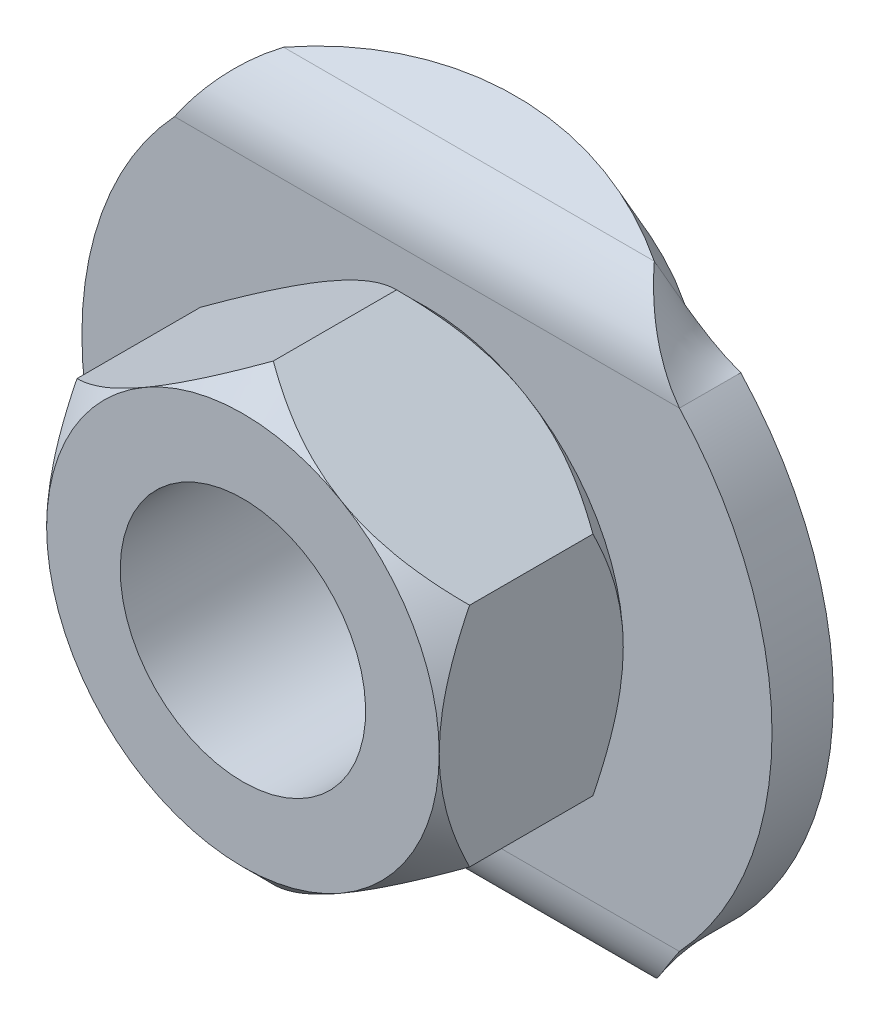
ISO-10303-21;
HEADER;
FILE_DESCRIPTION(('STEP AP214'),'2;1');
FILE_NAME('part.step','',(''),(''),'','','');
FILE_SCHEMA(('AUTOMOTIVE_DESIGN { 1 0 10303 214 1 1 1 1 }'));
ENDSEC;
DATA;
#1=APPLICATION_CONTEXT('core data for automotive mechanical design processes');
#2=APPLICATION_PROTOCOL_DEFINITION('international standard','automotive_design',2000,#1);
#3=PRODUCT_CONTEXT('',#1,'mechanical');
#4=PRODUCT('Part','Part','',(#3));
#5=PRODUCT_RELATED_PRODUCT_CATEGORY('part','',(#4));
#6=PRODUCT_DEFINITION_FORMATION('','',#4);
#7=PRODUCT_DEFINITION_CONTEXT('part definition',#1,'design');
#8=PRODUCT_DEFINITION('design','',#6,#7);
#9=PRODUCT_DEFINITION_SHAPE('','',#8);
#10=(LENGTH_UNIT() NAMED_UNIT(*) SI_UNIT(.MILLI.,.METRE.));
#11=(NAMED_UNIT(*) PLANE_ANGLE_UNIT() SI_UNIT($,.RADIAN.));
#12=(NAMED_UNIT(*) SI_UNIT($,.STERADIAN.) SOLID_ANGLE_UNIT());
#13=UNCERTAINTY_MEASURE_WITH_UNIT(LENGTH_MEASURE(1.E-05),#10,'distance_accuracy_value','');
#14=(GEOMETRIC_REPRESENTATION_CONTEXT(3) GLOBAL_UNCERTAINTY_ASSIGNED_CONTEXT((#13)) GLOBAL_UNIT_ASSIGNED_CONTEXT((#10,
#11,#12)) REPRESENTATION_CONTEXT('',''));
#15=CARTESIAN_POINT('',(0.,0.,0.));
#16=DIRECTION('',(0.,0.,1.));
#17=DIRECTION('',(1.,0.,0.));
#18=AXIS2_PLACEMENT_3D('',#15,#16,#17);
#19=CARTESIAN_POINT('',(0.,0.,7.00397605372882));
#20=DIRECTION('',(0.,0.,-1.));
#21=DIRECTION('',(-0.5,0.86602540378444,0.));
#22=AXIS2_PLACEMENT_3D('',#19,#20,#21);
#23=CONICAL_SURFACE('',#22,7.39602394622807,0.785398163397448);
#24=CARTESIAN_POINT('',(-1.4900885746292E-11,7.3900834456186,7.00991655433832));
#25=CARTESIAN_POINT('',(-0.110744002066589,7.32614536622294,7.0738447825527));
#26=CARTESIAN_POINT('',(-0.222344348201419,7.26171287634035,7.13579860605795));
#27=CARTESIAN_POINT('',(-0.447430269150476,7.13175945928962,7.2551541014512));
#28=CARTESIAN_POINT('',(-0.560916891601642,7.06623792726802,7.3125531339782));
#29=CARTESIAN_POINT('',(-0.905627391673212,6.8672192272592,7.47755291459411));
#30=CARTESIAN_POINT('',(-1.1397930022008,6.73202364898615,7.57718369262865));
#31=CARTESIAN_POINT('',(-1.60890537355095,6.46118149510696,7.74632080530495));
#32=CARTESIAN_POINT('',(-1.84363163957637,6.3256622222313,7.81661849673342));
#33=CARTESIAN_POINT('',(-2.19947237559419,6.12021747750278,7.89794625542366));
#34=CARTESIAN_POINT('',(-2.31856297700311,6.05146048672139,7.92102214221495));
#35=CARTESIAN_POINT('',(-2.55773886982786,5.91337222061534,7.95862409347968));
#36=CARTESIAN_POINT('',(-2.67782383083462,5.84404113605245,7.97315289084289));
#37=CARTESIAN_POINT('',(-2.8649003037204,5.7360324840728,7.98877491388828));
#38=CARTESIAN_POINT('',(-2.93170766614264,5.69746123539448,7.99297018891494));
#39=CARTESIAN_POINT('',(-3.06567459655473,5.62011539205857,7.9985898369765));
#40=CARTESIAN_POINT('',(-3.13283451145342,5.58134059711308,8.00000316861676));
#41=CARTESIAN_POINT('',(-3.20000000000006,5.54256258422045,7.99999999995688));
#42=B_SPLINE_CURVE_WITH_KNOTS('',3,(#24,#25,#26,#27,#28,#29,#30,#31,#32,#33,#34,#35,#36,#37,#38,
#39,#40,#41),.UNSPECIFIED.,.F.,.F.,(4,2,2,2,2,2,2,2,4),(0.,0.428870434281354,0.857987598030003,
1.72130127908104,2.55952433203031,2.97761259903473,3.39556711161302,3.6272919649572,
3.859934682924),.UNSPECIFIED.);
#43=CARTESIAN_POINT('',(0.,7.3900834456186,7.00991655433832));
#44=VERTEX_POINT('',#43);
#45=CARTESIAN_POINT('',(-3.19999999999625,5.54256258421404,7.99999999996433));
#46=VERTEX_POINT('',#45);
#47=EDGE_CURVE('E116',#44,#46,#42,.T.);
#48=ORIENTED_EDGE('',*,*,#47,.T.);
#49=CARTESIAN_POINT('',(0.,0.,7.99999999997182));
#50=DIRECTION('',(0.,0.,-1.));
#51=DIRECTION('',(-0.5,0.86602540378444,0.));
#52=AXIS2_PLACEMENT_3D('',#49,#50,#51);
#53=CIRCLE('',#52,6.39999999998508);
#54=CARTESIAN_POINT('',(3.1999999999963,5.542562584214,7.99999999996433));
#55=VERTEX_POINT('',#54);
#56=EDGE_CURVE('E375',#55,#46,#53,.F.);
#57=ORIENTED_EDGE('',*,*,#56,.F.);
#58=CARTESIAN_POINT('',(3.20000000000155,5.54256258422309,7.99999999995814));
#59=CARTESIAN_POINT('',(3.11487843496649,5.59170754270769,8.00001141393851));
#60=CARTESIAN_POINT('',(3.02976024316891,5.64085055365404,7.99773602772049));
#61=CARTESIAN_POINT('',(2.85971573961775,5.73902579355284,7.98869643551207));
#62=CARTESIAN_POINT('',(2.77478939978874,5.78805803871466,7.98193293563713));
#63=CARTESIAN_POINT('',(2.60543552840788,5.88583454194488,7.96401757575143));
#64=CARTESIAN_POINT('',(2.52100738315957,5.93457915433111,7.95287343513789));
#65=CARTESIAN_POINT('',(2.35265413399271,6.0317779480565,7.92635728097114));
#66=CARTESIAN_POINT('',(2.26872904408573,6.08023212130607,7.91098515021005));
#67=CARTESIAN_POINT('',(2.02044256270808,6.22358038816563,7.85934256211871));
#68=CARTESIAN_POINT('',(1.85696908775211,6.31796184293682,7.81725852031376));
#69=CARTESIAN_POINT('',(1.53315541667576,6.50491575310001,7.71929042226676));
#70=CARTESIAN_POINT('',(1.37281621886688,6.59748763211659,7.66340204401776));
#71=CARTESIAN_POINT('',(1.11058261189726,6.74888827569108,7.56127273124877));
#72=CARTESIAN_POINT('',(1.00768814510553,6.80829442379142,7.5183992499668));
#73=CARTESIAN_POINT('',(0.803407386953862,6.92623597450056,7.42817545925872));
#74=CARTESIAN_POINT('',(0.702020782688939,6.98477155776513,7.3808260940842));
#75=CARTESIAN_POINT('',(0.4996758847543,7.10159543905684,7.2816419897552));
#76=CARTESIAN_POINT('',(0.398732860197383,7.1598749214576,7.22976593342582));
#77=CARTESIAN_POINT('',(0.198295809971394,7.27559730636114,7.12242102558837));
#78=CARTESIAN_POINT('',(0.0988016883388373,7.33304026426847,7.06695241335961));
#79=CARTESIAN_POINT('',(1.49797261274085E-11,7.3900834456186,7.00991655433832));
#80=B_SPLINE_CURVE_WITH_KNOTS('',3,(#58,#59,#60,#61,#62,#63,#64,#65,#66,#67,#68,#69,#70,#71,#72,
#73,#74,#75,#76,#77,#78,#79),.UNSPECIFIED.,.F.,.F.,(4,2,2,2,2,2,2,2,2,2,4),(0.,
0.294836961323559,0.589627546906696,0.883900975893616,1.1781825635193,1.7577242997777,
2.33744771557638,2.71629282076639,3.09505818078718,3.47774006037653,3.86039647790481),.UNSPECIFIED.);
#81=EDGE_CURVE('E376',#55,#44,#80,.T.);
#82=ORIENTED_EDGE('',*,*,#81,.T.);
#83=EDGE_LOOP('',(#48,#57,#82));
#84=FACE_BOUND('',#83,.T.);
#85=ADVANCED_FACE('F14',(#84),#23,.T.);
#86=CARTESIAN_POINT('',(0.,0.,7.00397605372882));
#87=DIRECTION('',(0.,0.,-1.));
#88=DIRECTION('',(-0.5,0.86602540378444,0.));
#89=AXIS2_PLACEMENT_3D('',#86,#87,#88);
#90=CONICAL_SURFACE('',#89,7.39602394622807,0.785398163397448);
#91=CARTESIAN_POINT('',(-6.4,3.69504172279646,7.00991655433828));
#92=CARTESIAN_POINT('',(-6.39999999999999,3.56716556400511,7.07384478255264));
#93=CARTESIAN_POINT('',(-6.39999999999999,3.43830058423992,7.13579860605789));
#94=CARTESIAN_POINT('',(-6.39999999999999,3.17839375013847,7.25515410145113));
#95=CARTESIAN_POINT('',(-6.39999999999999,3.04735068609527,7.31255313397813));
#96=CARTESIAN_POINT('',(-6.39999999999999,2.64931328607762,7.47755291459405));
#97=CARTESIAN_POINT('',(-6.39999999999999,2.37892212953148,7.57718369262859));
#98=CARTESIAN_POINT('',(-6.4,1.83723782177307,7.74632080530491));
#99=CARTESIAN_POINT('',(-6.4,1.56619927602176,7.81661849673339));
#100=CARTESIAN_POINT('',(-6.4,1.15530978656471,7.89794625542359));
#101=CARTESIAN_POINT('',(-6.4,1.01779580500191,7.92102214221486));
#102=CARTESIAN_POINT('',(-6.4,0.741619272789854,7.95862409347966));
#103=CARTESIAN_POINT('',(-6.4,0.602957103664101,7.97315289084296));
#104=CARTESIAN_POINT('',(-6.4,0.386939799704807,7.9887749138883));
#105=CARTESIAN_POINT('',(-6.4,0.30979730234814,7.99297018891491));
#106=CARTESIAN_POINT('',(-6.4,0.155105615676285,7.99858983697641));
#107=CARTESIAN_POINT('',(-6.4,0.0775560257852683,8.00000316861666));
#108=CARTESIAN_POINT('',(-6.4,0.,7.99999999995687));
#109=B_SPLINE_CURVE_WITH_KNOTS('',3,(#91,#92,#93,#94,#95,#96,#97,#98,#99,#100,#101,#102,#103,
#104,#105,#106,#107,#108),.UNSPECIFIED.,.F.,.F.,(4,2,2,2,2,2,2,2,4),(0.,0.428870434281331,
0.857987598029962,1.72130127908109,2.55952433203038,2.97761259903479,3.39556711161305,
3.62729196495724,3.85993468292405),.UNSPECIFIED.);
#110=CARTESIAN_POINT('',(-6.39999999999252,3.69504172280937,7.00991655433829));
#111=VERTEX_POINT('',#110);
#112=CARTESIAN_POINT('',(-6.39999999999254,0.,7.99999999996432));
#113=VERTEX_POINT('',#112);
#114=EDGE_CURVE('E225',#111,#113,#109,.T.);
#115=ORIENTED_EDGE('',*,*,#114,.T.);
#116=CARTESIAN_POINT('',(0.,0.,7.99999999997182));
#117=DIRECTION('',(0.,0.,-1.));
#118=DIRECTION('',(-0.5,0.86602540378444,0.));
#119=AXIS2_PLACEMENT_3D('',#116,#117,#118);
#120=CIRCLE('',#119,6.39999999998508);
#121=EDGE_CURVE('E379',#46,#113,#120,.F.);
#122=ORIENTED_EDGE('',*,*,#121,.F.);
#123=CARTESIAN_POINT('',(-3.20000000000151,5.54256258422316,7.99999999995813));
#124=CARTESIAN_POINT('',(-3.2851215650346,5.49341762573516,8.00001141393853));
#125=CARTESIAN_POINT('',(-3.37023975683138,5.4442746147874,7.99773602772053));
#126=CARTESIAN_POINT('',(-3.54028426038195,5.34609937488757,7.98869643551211));
#127=CARTESIAN_POINT('',(-3.62521060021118,5.29706712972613,7.98193293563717));
#128=CARTESIAN_POINT('',(-3.7945644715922,5.19929062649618,7.96401757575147));
#129=CARTESIAN_POINT('',(-3.87899261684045,5.15054601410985,7.95287343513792));
#130=CARTESIAN_POINT('',(-4.04734586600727,5.05334722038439,7.92635728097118));
#131=CARTESIAN_POINT('',(-4.13127095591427,5.00489304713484,7.91098515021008));
#132=CARTESIAN_POINT('',(-4.37955743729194,4.86154478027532,7.85934256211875));
#133=CARTESIAN_POINT('',(-4.5430309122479,4.76716332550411,7.81725852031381));
#134=CARTESIAN_POINT('',(-4.86684458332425,4.58020941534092,7.71929042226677));
#135=CARTESIAN_POINT('',(-5.02718378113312,4.48763753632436,7.66340204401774));
#136=CARTESIAN_POINT('',(-5.28941738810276,4.33623689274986,7.56127273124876));
#137=CARTESIAN_POINT('',(-5.39231185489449,4.2768307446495,7.51839924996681));
#138=CARTESIAN_POINT('',(-5.59659261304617,4.15888919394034,7.42817545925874));
#139=CARTESIAN_POINT('',(-5.6979792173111,4.10035361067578,7.3808260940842));
#140=CARTESIAN_POINT('',(-5.90032411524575,3.98352972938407,7.2816419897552));
#141=CARTESIAN_POINT('',(-6.00126713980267,3.92525024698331,7.22976593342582));
#142=CARTESIAN_POINT('',(-6.20170419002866,3.80952786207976,7.12242102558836));
#143=CARTESIAN_POINT('',(-6.30119831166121,3.75208490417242,7.06695241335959));
#144=CARTESIAN_POINT('',(-6.39999999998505,3.69504172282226,7.00991655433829));
#145=B_SPLINE_CURVE_WITH_KNOTS('',3,(#123,#124,#125,#126,#127,#128,#129,#130,#131,#132,#133,
#134,#135,#136,#137,#138,#139,#140,#141,#142,#143,#144),.UNSPECIFIED.,.F.,.F.,(4,2,2,2,2,2,2,2,
2,2,4),(0.,0.294836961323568,0.589627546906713,0.883900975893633,1.17818256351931,
1.75772429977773,2.33744771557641,2.71629282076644,3.09505818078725,3.47774006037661,
3.86039647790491),.UNSPECIFIED.);
#146=EDGE_CURVE('E120',#46,#111,#145,.T.);
#147=ORIENTED_EDGE('',*,*,#146,.T.);
#148=EDGE_LOOP('',(#115,#122,#147));
#149=FACE_BOUND('',#148,.T.);
#150=ADVANCED_FACE('F356',(#149),#90,.T.);
#151=CARTESIAN_POINT('',(0.,0.,7.00397605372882));
#152=DIRECTION('',(0.,0.,-1.));
#153=DIRECTION('',(-0.5,0.86602540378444,0.));
#154=AXIS2_PLACEMENT_3D('',#151,#152,#153);
#155=CONICAL_SURFACE('',#154,7.39602394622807,0.785398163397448);
#156=CARTESIAN_POINT('',(0.,0.,7.99999999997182));
#157=DIRECTION('',(0.,0.,-1.));
#158=DIRECTION('',(-0.5,0.86602540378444,0.));
#159=AXIS2_PLACEMENT_3D('',#156,#157,#158);
#160=CIRCLE('',#159,6.39999999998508);
#161=CARTESIAN_POINT('',(-3.19999999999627,-5.54256258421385,7.99999999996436));
#162=VERTEX_POINT('',#161);
#163=EDGE_CURVE('E80',#113,#162,#160,.F.);
#164=ORIENTED_EDGE('',*,*,#163,.F.);
#165=CARTESIAN_POINT('',(-6.40000000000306,0.,7.99999999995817));
#166=CARTESIAN_POINT('',(-6.4000000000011,-0.0982899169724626,8.00001141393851));
#167=CARTESIAN_POINT('',(-6.4000000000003,-0.196575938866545,7.99773602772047));
#168=CARTESIAN_POINT('',(-6.39999999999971,-0.392926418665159,7.98869643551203));
#169=CARTESIAN_POINT('',(-6.39999999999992,-0.490990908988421,7.9819329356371));
#170=CARTESIAN_POINT('',(-6.40000000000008,-0.686543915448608,7.9640175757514));
#171=CARTESIAN_POINT('',(-6.40000000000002,-0.784033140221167,7.95287343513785));
#172=CARTESIAN_POINT('',(-6.39999999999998,-0.978430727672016,7.9263572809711));
#173=CARTESIAN_POINT('',(-6.4,-1.07533907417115,7.91098515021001));
#174=CARTESIAN_POINT('',(-6.40000000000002,-1.36203560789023,7.85934256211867));
#175=CARTESIAN_POINT('',(-6.40000000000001,-1.55079851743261,7.8172585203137));
#176=CARTESIAN_POINT('',(-6.4,-1.92470633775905,7.71929042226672));
#177=CARTESIAN_POINT('',(-6.4,-2.10985009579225,7.66340204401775));
#178=CARTESIAN_POINT('',(-6.4,-2.41265138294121,7.56127273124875));
#179=CARTESIAN_POINT('',(-6.40000000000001,-2.53146367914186,7.51839924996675));
#180=CARTESIAN_POINT('',(-6.40000000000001,-2.7673467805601,7.42817545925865));
#181=CARTESIAN_POINT('',(-6.40000000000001,-2.88441794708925,7.38082609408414));
#182=CARTESIAN_POINT('',(-6.40000000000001,-3.11806570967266,7.28164198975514));
#183=CARTESIAN_POINT('',(-6.40000000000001,-3.23462467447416,7.22976593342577));
#184=CARTESIAN_POINT('',(-6.40000000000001,-3.46606944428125,7.12242102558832));
#185=CARTESIAN_POINT('',(-6.40000000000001,-3.58095536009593,7.06695241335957));
#186=CARTESIAN_POINT('',(-6.4,-3.69504172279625,7.0099165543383));
#187=B_SPLINE_CURVE_WITH_KNOTS('',3,(#165,#166,#167,#168,#169,#170,#171,#172,#173,#174,#175,
#176,#177,#178,#179,#180,#181,#182,#183,#184,#185,#186),.UNSPECIFIED.,.F.,.F.,(4,2,2,2,2,2,2,2,
2,2,4),(0.,0.294836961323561,0.589627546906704,0.883900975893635,1.17818256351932,
1.75772429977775,2.33744771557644,2.71629282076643,3.09505818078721,3.47774006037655,
3.86039647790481),.UNSPECIFIED.);
#188=CARTESIAN_POINT('',(-6.39999999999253,-3.69504172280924,7.0099165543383));
#189=VERTEX_POINT('',#188);
#190=EDGE_CURVE('E367',#113,#189,#187,.T.);
#191=ORIENTED_EDGE('',*,*,#190,.T.);
#192=CARTESIAN_POINT('',(-6.39999999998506,-3.69504172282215,7.00991655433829));
#193=CARTESIAN_POINT('',(-6.28925599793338,-3.75897980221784,7.07384478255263));
#194=CARTESIAN_POINT('',(-6.17765565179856,-3.82341229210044,7.13579860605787));
#195=CARTESIAN_POINT('',(-5.95256973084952,-3.95336570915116,7.2551541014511));
#196=CARTESIAN_POINT('',(-5.83908310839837,-4.01888724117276,7.3125531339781));
#197=CARTESIAN_POINT('',(-5.49437260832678,-4.21790594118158,7.47755291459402));
#198=CARTESIAN_POINT('',(-5.26020699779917,-4.35310151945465,7.57718369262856));
#199=CARTESIAN_POINT('',(-4.791094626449,-4.62394367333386,7.74632080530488));
#200=CARTESIAN_POINT('',(-4.55636836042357,-4.75946294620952,7.81661849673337));
#201=CARTESIAN_POINT('',(-4.20052762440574,-4.96490769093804,7.89794625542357));
#202=CARTESIAN_POINT('',(-4.08143702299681,-5.03366468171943,7.92102214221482));
#203=CARTESIAN_POINT('',(-3.84226113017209,-5.17175294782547,7.95862409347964));
#204=CARTESIAN_POINT('',(-3.72217616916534,-5.24108403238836,7.97315289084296));
#205=CARTESIAN_POINT('',(-3.53509969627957,-5.349092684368,7.98877491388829));
#206=CARTESIAN_POINT('',(-3.46829233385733,-5.38766393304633,7.99297018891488));
#207=CARTESIAN_POINT('',(-3.33432540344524,-5.46500977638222,7.99858983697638));
#208=CARTESIAN_POINT('',(-3.26716548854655,-5.50378457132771,8.00000316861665));
#209=CARTESIAN_POINT('',(-3.19999999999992,-5.54256258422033,7.99999999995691));
#210=B_SPLINE_CURVE_WITH_KNOTS('',3,(#192,#193,#194,#195,#196,#197,#198,#199,#200,#201,#202,
#203,#204,#205,#206,#207,#208,#209),.UNSPECIFIED.,.F.,.F.,(4,2,2,2,2,2,2,2,4),(0.,
0.428870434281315,0.857987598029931,1.72130127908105,2.55952433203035,2.97761259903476,
3.39556711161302,3.62729196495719,3.85993468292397),.UNSPECIFIED.);
#211=EDGE_CURVE('E226',#189,#162,#210,.T.);
#212=ORIENTED_EDGE('',*,*,#211,.T.);
#213=EDGE_LOOP('',(#164,#191,#212));
#214=FACE_BOUND('',#213,.T.);
#215=ADVANCED_FACE('F359',(#214),#155,.T.);
#216=CARTESIAN_POINT('',(0.,0.,7.00397605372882));
#217=DIRECTION('',(0.,0.,-1.));
#218=DIRECTION('',(-0.5,0.86602540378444,0.));
#219=AXIS2_PLACEMENT_3D('',#216,#217,#218);
#220=CONICAL_SURFACE('',#219,7.39602394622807,0.785398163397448);
#221=CARTESIAN_POINT('',(6.3999999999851,3.69504172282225,7.0099165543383));
#222=CARTESIAN_POINT('',(6.28925599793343,3.75897980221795,7.07384478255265));
#223=CARTESIAN_POINT('',(6.1776556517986,3.82341229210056,7.13579860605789));
#224=CARTESIAN_POINT('',(5.95256973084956,3.95336570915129,7.25515410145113));
#225=CARTESIAN_POINT('',(5.8390831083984,4.01888724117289,7.31255313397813));
#226=CARTESIAN_POINT('',(5.49437260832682,4.2179059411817,7.47755291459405));
#227=CARTESIAN_POINT('',(5.26020699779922,4.35310151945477,7.57718369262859));
#228=CARTESIAN_POINT('',(4.79109462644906,4.62394367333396,7.7463208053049));
#229=CARTESIAN_POINT('',(4.55636836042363,4.75946294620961,7.81661849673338));
#230=CARTESIAN_POINT('',(4.20052762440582,4.96490769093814,7.8979462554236));
#231=CARTESIAN_POINT('',(4.0814370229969,5.03366468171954,7.92102214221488));
#232=CARTESIAN_POINT('',(3.84226113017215,5.17175294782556,7.95862409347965));
#233=CARTESIAN_POINT('',(3.72217616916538,5.24108403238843,7.97315289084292));
#234=CARTESIAN_POINT('',(3.53509969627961,5.34909268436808,7.98877491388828));
#235=CARTESIAN_POINT('',(3.46829233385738,5.38766393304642,7.99297018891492));
#236=CARTESIAN_POINT('',(3.33432540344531,5.46500977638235,7.99858983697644));
#237=CARTESIAN_POINT('',(3.26716548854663,5.50378457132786,8.0000031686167));
#238=CARTESIAN_POINT('',(3.2,5.54256258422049,7.99999999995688));
#239=B_SPLINE_CURVE_WITH_KNOTS('',3,(#221,#222,#223,#224,#225,#226,#227,#228,#229,#230,#231,
#232,#233,#234,#235,#236,#237,#238),.UNSPECIFIED.,.F.,.F.,(4,2,2,2,2,2,2,2,4),(0.,
0.428870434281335,0.857987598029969,1.72130127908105,2.55952433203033,2.97761259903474,
3.39556711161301,3.62729196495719,3.85993468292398),.UNSPECIFIED.);
#240=CARTESIAN_POINT('',(6.39999999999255,3.69504172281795,7.009916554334));
#241=VERTEX_POINT('',#240);
#242=EDGE_CURVE('E350',#241,#55,#239,.T.);
#243=ORIENTED_EDGE('',*,*,#242,.T.);
#244=CARTESIAN_POINT('',(0.,0.,7.99999999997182));
#245=DIRECTION('',(0.,0.,-1.));
#246=DIRECTION('',(-0.5,0.86602540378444,0.));
#247=AXIS2_PLACEMENT_3D('',#244,#245,#246);
#248=CIRCLE('',#247,6.39999999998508);
#249=CARTESIAN_POINT('',(6.39999999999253,0.,7.99999999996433));
#250=VERTEX_POINT('',#249);
#251=EDGE_CURVE('E382',#250,#55,#248,.F.);
#252=ORIENTED_EDGE('',*,*,#251,.F.);
#253=CARTESIAN_POINT('',(6.40000000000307,0.,7.99999999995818));
#254=CARTESIAN_POINT('',(6.4000000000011,0.0982899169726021,8.00001141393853));
#255=CARTESIAN_POINT('',(6.4000000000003,0.196575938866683,7.9977360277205));
#256=CARTESIAN_POINT('',(6.39999999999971,0.392926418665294,7.98869643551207));
#257=CARTESIAN_POINT('',(6.39999999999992,0.490990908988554,7.98193293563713));
#258=CARTESIAN_POINT('',(6.40000000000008,0.686543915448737,7.96401757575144));
#259=CARTESIAN_POINT('',(6.40000000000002,0.784033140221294,7.95287343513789));
#260=CARTESIAN_POINT('',(6.39999999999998,0.978430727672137,7.92635728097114));
#261=CARTESIAN_POINT('',(6.4,1.07533907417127,7.91098515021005));
#262=CARTESIAN_POINT('',(6.40000000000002,1.36203560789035,7.85934256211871));
#263=CARTESIAN_POINT('',(6.40000000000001,1.55079851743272,7.81725852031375));
#264=CARTESIAN_POINT('',(6.4,1.92470633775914,7.71929042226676));
#265=CARTESIAN_POINT('',(6.4,2.10985009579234,7.66340204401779));
#266=CARTESIAN_POINT('',(6.4,2.4126513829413,7.56127273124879));
#267=CARTESIAN_POINT('',(6.40000000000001,2.53146367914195,7.51839924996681));
#268=CARTESIAN_POINT('',(6.40000000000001,2.76734678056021,7.42817545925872));
#269=CARTESIAN_POINT('',(6.40000000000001,2.88441794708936,7.38082609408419));
#270=CARTESIAN_POINT('',(6.40000000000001,3.11806570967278,7.2816419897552));
#271=CARTESIAN_POINT('',(6.40000000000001,3.23462467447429,7.22976593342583));
#272=CARTESIAN_POINT('',(6.40000000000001,3.46606944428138,7.12242102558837));
#273=CARTESIAN_POINT('',(6.40000000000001,3.58095536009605,7.0669524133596));
#274=CARTESIAN_POINT('',(6.4,3.69504172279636,7.00991655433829));
#275=B_SPLINE_CURVE_WITH_KNOTS('',3,(#253,#254,#255,#256,#257,#258,#259,#260,#261,#262,#263,
#264,#265,#266,#267,#268,#269,#270,#271,#272,#273,#274),.UNSPECIFIED.,.F.,.F.,(4,2,2,2,2,2,2,2,
2,2,4),(0.,0.294836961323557,0.589627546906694,0.883900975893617,1.1781825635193,
1.75772429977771,2.33744771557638,2.71629282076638,3.09505818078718,3.47774006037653,
3.8603964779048),.UNSPECIFIED.);
#276=EDGE_CURVE('E469',#250,#241,#275,.T.);
#277=ORIENTED_EDGE('',*,*,#276,.T.);
#278=EDGE_LOOP('',(#243,#252,#277));
#279=FACE_BOUND('',#278,.T.);
#280=ADVANCED_FACE('F210',(#279),#220,.T.);
#281=CARTESIAN_POINT('',(0.,0.,7.00397605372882));
#282=DIRECTION('',(0.,0.,-1.));
#283=DIRECTION('',(-0.5,0.86602540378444,0.));
#284=AXIS2_PLACEMENT_3D('',#281,#282,#283);
#285=CONICAL_SURFACE('',#284,7.39602394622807,0.785398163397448);
#286=CARTESIAN_POINT('',(1.4921603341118E-11,-7.3900834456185,7.00991655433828));
#287=CARTESIAN_POINT('',(0.110744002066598,-7.32614536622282,7.07384478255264));
#288=CARTESIAN_POINT('',(0.222344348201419,-7.26171287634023,7.13579860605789));
#289=CARTESIAN_POINT('',(0.447430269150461,-7.13175945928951,7.25515410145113));
#290=CARTESIAN_POINT('',(0.560916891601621,-7.06623792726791,7.31255313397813));
#291=CARTESIAN_POINT('',(0.905627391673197,-6.86721922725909,7.47755291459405));
#292=CARTESIAN_POINT('',(1.1397930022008,-6.73202364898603,7.57718369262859));
#293=CARTESIAN_POINT('',(1.60890537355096,-6.46118149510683,7.7463208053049));
#294=CARTESIAN_POINT('',(1.84363163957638,-6.32566222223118,7.81661849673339));
#295=CARTESIAN_POINT('',(2.1994723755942,-6.12021747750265,7.8979462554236));
#296=CARTESIAN_POINT('',(2.31856297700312,-6.05146048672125,7.92102214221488));
#297=CARTESIAN_POINT('',(2.55773886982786,-5.91337222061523,7.95862409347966));
#298=CARTESIAN_POINT('',(2.67782383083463,-5.84404113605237,7.97315289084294));
#299=CARTESIAN_POINT('',(2.86490030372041,-5.73603248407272,7.9887749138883));
#300=CARTESIAN_POINT('',(2.93170766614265,-5.69746123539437,7.99297018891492));
#301=CARTESIAN_POINT('',(3.06567459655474,-5.62011539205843,7.99858983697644));
#302=CARTESIAN_POINT('',(3.13283451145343,-5.58134059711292,8.0000031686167));
#303=CARTESIAN_POINT('',(3.20000000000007,-5.54256258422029,7.99999999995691));
#304=B_SPLINE_CURVE_WITH_KNOTS('',3,(#286,#287,#288,#289,#290,#291,#292,#293,#294,#295,#296,
#297,#298,#299,#300,#301,#302,#303),.UNSPECIFIED.,.F.,.F.,(4,2,2,2,2,2,2,2,4),(0.,
0.428870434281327,0.857987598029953,1.72130127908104,2.55952433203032,2.97761259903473,
3.39556711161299,3.6272919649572,3.85993468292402),.UNSPECIFIED.);
#305=CARTESIAN_POINT('',(0.,-7.3900834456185,7.00991655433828));
#306=VERTEX_POINT('',#305);
#307=CARTESIAN_POINT('',(3.19999999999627,-5.5425625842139,7.99999999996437));
#308=VERTEX_POINT('',#307);
#309=EDGE_CURVE('E188',#306,#308,#304,.T.);
#310=ORIENTED_EDGE('',*,*,#309,.T.);
#311=CARTESIAN_POINT('',(0.,0.,7.99999999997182));
#312=DIRECTION('',(0.,0.,-1.));
#313=DIRECTION('',(-0.5,0.86602540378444,0.));
#314=AXIS2_PLACEMENT_3D('',#311,#312,#313);
#315=CIRCLE('',#314,6.39999999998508);
#316=EDGE_CURVE('E18',#162,#308,#315,.F.);
#317=ORIENTED_EDGE('',*,*,#316,.F.);
#318=CARTESIAN_POINT('',(-3.20000000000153,-5.54256258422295,7.99999999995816));
#319=CARTESIAN_POINT('',(-3.11487843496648,-5.59170754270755,8.00001141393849));
#320=CARTESIAN_POINT('',(-3.02976024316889,-5.6408505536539,7.99773602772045));
#321=CARTESIAN_POINT('',(-2.85971573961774,-5.7390257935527,7.98869643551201));
#322=CARTESIAN_POINT('',(-2.77478939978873,-5.78805803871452,7.98193293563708));
#323=CARTESIAN_POINT('',(-2.60543552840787,-5.88583454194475,7.96401757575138));
#324=CARTESIAN_POINT('',(-2.52100738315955,-5.93457915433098,7.95287343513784));
#325=CARTESIAN_POINT('',(-2.35265413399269,-6.03177794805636,7.92635728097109));
#326=CARTESIAN_POINT('',(-2.2687290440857,-6.08023212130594,7.91098515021));
#327=CARTESIAN_POINT('',(-2.02044256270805,-6.2235803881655,7.85934256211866));
#328=CARTESIAN_POINT('',(-1.85696908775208,-6.31796184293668,7.81725852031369));
#329=CARTESIAN_POINT('',(-1.53315541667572,-6.5049157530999,7.71929042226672));
#330=CARTESIAN_POINT('',(-1.37281621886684,-6.59748763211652,7.66340204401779));
#331=CARTESIAN_POINT('',(-1.11058261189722,-6.74888827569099,7.56127273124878));
#332=CARTESIAN_POINT('',(-1.0076881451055,-6.8082944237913,7.51839924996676));
#333=CARTESIAN_POINT('',(-0.803407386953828,-6.92623597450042,7.42817545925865));
#334=CARTESIAN_POINT('',(-0.702020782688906,-6.984771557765,7.38082609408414));
#335=CARTESIAN_POINT('',(-0.499675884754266,-7.10159543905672,7.28164198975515));
#336=CARTESIAN_POINT('',(-0.398732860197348,-7.15987492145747,7.22976593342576));
#337=CARTESIAN_POINT('',(-0.198295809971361,-7.27559730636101,7.12242102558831));
#338=CARTESIAN_POINT('',(-0.0988016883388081,-7.33304026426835,7.06695241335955));
#339=CARTESIAN_POINT('',(-1.49572738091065E-11,-7.3900834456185,7.00991655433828));
#340=B_SPLINE_CURVE_WITH_KNOTS('',3,(#318,#319,#320,#321,#322,#323,#324,#325,#326,#327,#328,
#329,#330,#331,#332,#333,#334,#335,#336,#337,#338,#339),.UNSPECIFIED.,.F.,.F.,(4,2,2,2,2,2,2,2,
2,2,4),(0.,0.294836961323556,0.589627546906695,0.883900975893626,1.17818256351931,
1.75772429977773,2.33744771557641,2.71629282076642,3.09505818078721,3.47774006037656,
3.86039647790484),.UNSPECIFIED.);
#341=EDGE_CURVE('E216',#162,#306,#340,.T.);
#342=ORIENTED_EDGE('',*,*,#341,.T.);
#343=EDGE_LOOP('',(#310,#317,#342));
#344=FACE_BOUND('',#343,.T.);
#345=ADVANCED_FACE('F206',(#344),#285,.T.);
#346=CARTESIAN_POINT('',(0.,0.,7.00397605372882));
#347=DIRECTION('',(0.,0.,-1.));
#348=DIRECTION('',(-0.5,0.86602540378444,0.));
#349=AXIS2_PLACEMENT_3D('',#346,#347,#348);
#350=CONICAL_SURFACE('',#349,7.39602394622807,0.785398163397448);
#351=CARTESIAN_POINT('',(6.4,-3.69504172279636,7.00991655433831));
#352=CARTESIAN_POINT('',(6.39999999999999,-3.56716556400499,7.07384478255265));
#353=CARTESIAN_POINT('',(6.39999999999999,-3.4383005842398,7.13579860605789));
#354=CARTESIAN_POINT('',(6.39999999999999,-3.17839375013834,7.25515410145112));
#355=CARTESIAN_POINT('',(6.39999999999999,-3.04735068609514,7.31255313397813));
#356=CARTESIAN_POINT('',(6.39999999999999,-2.64931328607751,7.47755291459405));
#357=CARTESIAN_POINT('',(6.39999999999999,-2.37892212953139,7.57718369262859));
#358=CARTESIAN_POINT('',(6.4,-1.83723782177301,7.74632080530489));
#359=CARTESIAN_POINT('',(6.4,-1.5661992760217,7.81661849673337));
#360=CARTESIAN_POINT('',(6.4,-1.15530978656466,7.89794625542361));
#361=CARTESIAN_POINT('',(6.4,-1.01779580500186,7.92102214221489));
#362=CARTESIAN_POINT('',(6.4,-0.741619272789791,7.95862409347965));
#363=CARTESIAN_POINT('',(6.4,-0.602957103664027,7.97315289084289));
#364=CARTESIAN_POINT('',(6.4,-0.386939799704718,7.98877491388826));
#365=CARTESIAN_POINT('',(6.4,-0.309797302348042,7.99297018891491));
#366=CARTESIAN_POINT('',(6.4,-0.155105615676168,7.99858983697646));
#367=CARTESIAN_POINT('',(6.4,-0.0775560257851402,8.00000316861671));
#368=CARTESIAN_POINT('',(6.4,1.70987904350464E-13,7.99999999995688));
#369=B_SPLINE_CURVE_WITH_KNOTS('',3,(#351,#352,#353,#354,#355,#356,#357,#358,#359,#360,#361,
#362,#363,#364,#365,#366,#367,#368),.UNSPECIFIED.,.F.,.F.,(4,2,2,2,2,2,2,2,4),(0.,
0.42887043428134,0.857987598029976,1.72130127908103,2.55952433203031,2.97761259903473,
3.395567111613,3.62729196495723,3.85993468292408),.UNSPECIFIED.);
#370=CARTESIAN_POINT('',(6.4,-3.69504172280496,7.00991655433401));
#371=VERTEX_POINT('',#370);
#372=EDGE_CURVE('E468',#371,#250,#369,.T.);
#373=ORIENTED_EDGE('',*,*,#372,.T.);
#374=CARTESIAN_POINT('',(0.,0.,7.99999999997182));
#375=DIRECTION('',(0.,0.,-1.));
#376=DIRECTION('',(-0.5,0.86602540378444,0.));
#377=AXIS2_PLACEMENT_3D('',#374,#375,#376);
#378=CIRCLE('',#377,6.39999999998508);
#379=EDGE_CURVE('E385',#308,#250,#378,.F.);
#380=ORIENTED_EDGE('',*,*,#379,.F.);
#381=CARTESIAN_POINT('',(3.20000000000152,-5.542562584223,7.99999999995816));
#382=CARTESIAN_POINT('',(3.28512156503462,-5.49341762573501,8.00001141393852));
#383=CARTESIAN_POINT('',(3.3702397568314,-5.44427461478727,7.99773602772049));
#384=CARTESIAN_POINT('',(3.54028426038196,-5.34609937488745,7.98869643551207));
#385=CARTESIAN_POINT('',(3.62521060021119,-5.29706712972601,7.98193293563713));
#386=CARTESIAN_POINT('',(3.79456447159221,-5.19929062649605,7.96401757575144));
#387=CARTESIAN_POINT('',(3.87899261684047,-5.15054601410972,7.95287343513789));
#388=CARTESIAN_POINT('',(4.04734586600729,-5.05334722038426,7.92635728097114));
#389=CARTESIAN_POINT('',(4.13127095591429,-5.00489304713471,7.91098515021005));
#390=CARTESIAN_POINT('',(4.37955743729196,-4.86154478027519,7.85934256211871));
#391=CARTESIAN_POINT('',(4.54303091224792,-4.767163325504,7.81725852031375));
#392=CARTESIAN_POINT('',(4.86684458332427,-4.58020941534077,7.71929042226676));
#393=CARTESIAN_POINT('',(5.02718378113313,-4.48763753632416,7.6634020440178));
#394=CARTESIAN_POINT('',(5.28941738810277,-4.33623689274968,7.5612727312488));
#395=CARTESIAN_POINT('',(5.3923118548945,-4.27683074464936,7.5183992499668));
#396=CARTESIAN_POINT('',(5.59659261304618,-4.15888919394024,7.4281754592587));
#397=CARTESIAN_POINT('',(5.6979792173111,-4.10035361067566,7.38082609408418));
#398=CARTESIAN_POINT('',(5.90032411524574,-3.98352972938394,7.28164198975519));
#399=CARTESIAN_POINT('',(6.00126713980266,-3.92525024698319,7.22976593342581));
#400=CARTESIAN_POINT('',(6.20170419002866,-3.80952786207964,7.12242102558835));
#401=CARTESIAN_POINT('',(6.30119831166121,-3.75208490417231,7.06695241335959));
#402=CARTESIAN_POINT('',(6.39999999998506,-3.69504172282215,7.0099165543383));
#403=B_SPLINE_CURVE_WITH_KNOTS('',3,(#381,#382,#383,#384,#385,#386,#387,#388,#389,#390,#391,
#392,#393,#394,#395,#396,#397,#398,#399,#400,#401,#402),.UNSPECIFIED.,.F.,.F.,(4,2,2,2,2,2,2,2,
2,2,4),(0.,0.29483696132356,0.589627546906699,0.883900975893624,1.17818256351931,
1.75772429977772,2.3374477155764,2.71629282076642,3.09505818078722,3.47774006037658,
3.86039647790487),.UNSPECIFIED.);
#404=EDGE_CURVE('E197',#308,#371,#403,.T.);
#405=ORIENTED_EDGE('',*,*,#404,.T.);
#406=EDGE_LOOP('',(#373,#380,#405));
#407=FACE_BOUND('',#406,.T.);
#408=ADVANCED_FACE('F209',(#407),#350,.T.);
#409=CARTESIAN_POINT('',(3.20000000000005,5.54256258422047,8.));
#410=DIRECTION('',(-0.5,-0.866025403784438,0.));
#411=DIRECTION('',(0.866025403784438,-0.5,0.));
#412=AXIS2_PLACEMENT_3D('',#409,#410,#411);
#413=PLANE('',#412);
#414=DIRECTION('',(0.,0.,1.));
#415=VECTOR('',#414,1.);
#416=CARTESIAN_POINT('',(6.4,3.69504172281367,8.));
#417=LINE('',#416,#415);
#418=CARTESIAN_POINT('',(6.39999996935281,3.69504174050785,2.99008342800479));
#419=VERTEX_POINT('',#418);
#420=EDGE_CURVE('E466',#241,#419,#417,.F.);
#421=ORIENTED_EDGE('',*,*,#420,.T.);
#422=CARTESIAN_POINT('',(3.20000000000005,5.54256258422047,2.00000000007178));
#423=CARTESIAN_POINT('',(3.28512156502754,5.49341762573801,1.99998858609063));
#424=CARTESIAN_POINT('',(3.37023975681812,5.44427461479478,2.00226397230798));
#425=CARTESIAN_POINT('',(3.54028426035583,5.34609937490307,2.01130356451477));
#426=CARTESIAN_POINT('',(3.6252106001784,5.29706712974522,2.01806706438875));
#427=CARTESIAN_POINT('',(3.7945644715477,5.19929062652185,2.03598242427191));
#428=CARTESIAN_POINT('',(3.8789926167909,5.15054601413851,2.04712656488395));
#429=CARTESIAN_POINT('',(4.04734586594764,5.05334722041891,2.07364271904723));
#430=CARTESIAN_POINT('',(4.13127095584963,5.00489304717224,2.08901484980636));
#431=CARTESIAN_POINT('',(4.37955743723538,4.86154478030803,2.14065743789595));
#432=CARTESIAN_POINT('',(4.54303091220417,4.76716332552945,2.18274147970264));
#433=CARTESIAN_POINT('',(4.86684458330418,4.58020941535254,2.28070957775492));
#434=CARTESIAN_POINT('',(5.02718378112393,4.4876375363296,2.33659795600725));
#435=CARTESIAN_POINT('',(5.2894173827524,4.33623689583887,2.43872726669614));
#436=CARTESIAN_POINT('',(5.39231184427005,4.27683075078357,2.48160074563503));
#437=CARTESIAN_POINT('',(5.59659259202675,4.158889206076,2.57182453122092));
#438=CARTESIAN_POINT('',(5.69797919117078,4.10035362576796,2.61917389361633));
#439=CARTESIAN_POINT('',(5.90032407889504,3.98352975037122,2.71835799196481));
#440=CARTESIAN_POINT('',(6.00126709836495,3.92525027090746,2.77023404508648));
#441=CARTESIAN_POINT('',(6.20170413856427,3.8095278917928,2.87757894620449));
#442=CARTESIAN_POINT('',(6.30119825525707,3.75208493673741,2.93304755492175));
#443=CARTESIAN_POINT('',(6.39999993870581,3.69504175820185,2.99008341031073));
#444=B_SPLINE_CURVE_WITH_KNOTS('',3,(#422,#423,#424,#425,#426,#427,#428,#429,#430,#431,#432,
#433,#434,#435,#436,#437,#438,#439,#440,#441,#442,#443),.UNSPECIFIED.,.F.,.F.,(4,2,2,2,2,2,2,2,
2,2,4),(0.,0.29483696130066,0.589627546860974,0.883900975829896,1.1781825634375,
1.75772429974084,2.33744771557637,2.71629280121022,3.09505814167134,3.47774000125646,
3.86039639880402),.UNSPECIFIED.);
#445=CARTESIAN_POINT('',(3.1999999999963,5.54256258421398,2.00000000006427));
#446=VERTEX_POINT('',#445);
#447=EDGE_CURVE('E132',#446,#419,#444,.T.);
#448=ORIENTED_EDGE('',*,*,#447,.F.);
#449=CARTESIAN_POINT('',(-2.17159173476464E-08,7.39008342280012,2.99008346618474));
#450=CARTESIAN_POINT('',(0.110743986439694,7.32614536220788,2.92615522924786));
#451=CARTESIAN_POINT('',(0.222344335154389,7.26171288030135,2.86420140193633));
#452=CARTESIAN_POINT('',(0.447430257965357,7.13175946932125,2.74484590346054));
#453=CARTESIAN_POINT('',(0.5609168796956,7.06623793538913,2.68744687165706));
#454=CARTESIAN_POINT('',(0.905627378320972,6.86721923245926,2.52244709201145));
#455=CARTESIAN_POINT('',(1.13979298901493,6.73202365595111,2.42281631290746));
#456=CARTESIAN_POINT('',(1.60890535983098,6.4611815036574,2.25367919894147));
#457=CARTESIAN_POINT('',(1.84363162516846,6.32566223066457,2.18338150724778));
#458=CARTESIAN_POINT('',(2.19947236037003,6.12021748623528,2.10205374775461));
#459=CARTESIAN_POINT('',(2.31856296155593,6.0514604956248,2.07897786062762));
#460=CARTESIAN_POINT('',(2.5577388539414,5.91337222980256,2.04137590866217));
#461=CARTESIAN_POINT('',(2.67782381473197,5.84404114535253,2.02684711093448));
#462=CARTESIAN_POINT('',(2.86490029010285,5.73603249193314,2.01122508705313));
#463=CARTESIAN_POINT('',(2.93170765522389,5.69746124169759,2.00702981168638));
#464=CARTESIAN_POINT('',(3.06567459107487,5.62011539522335,2.00141016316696));
#465=CARTESIAN_POINT('',(3.13283450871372,5.58134059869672,1.99999683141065));
#466=CARTESIAN_POINT('',(3.20000000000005,5.54256258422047,2.00000000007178));
#467=B_SPLINE_CURVE_WITH_KNOTS('',3,(#449,#450,#451,#452,#453,#454,#455,#456,#457,#458,#459,
#460,#461,#462,#463,#464,#465,#466),.UNSPECIFIED.,.F.,.F.,(4,2,2,2,2,2,2,2,4),(0.,
0.42887043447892,0.857987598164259,1.72130127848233,2.55952432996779,2.97761259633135,
3.39556710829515,3.62729197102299,3.85993469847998),.UNSPECIFIED.);
#468=CARTESIAN_POINT('',(-3.06471984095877E-08,7.3900834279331,2.99008342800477));
#469=VERTEX_POINT('',#468);
#470=EDGE_CURVE('E125',#469,#446,#467,.T.);
#471=ORIENTED_EDGE('',*,*,#470,.F.);
#472=DIRECTION('',(0.,0.,1.));
#473=VECTOR('',#472,1.);
#474=CARTESIAN_POINT('',(0.,7.39008344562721,8.));
#475=LINE('',#474,#473);
#476=EDGE_CURVE('E108',#469,#44,#475,.T.);
#477=ORIENTED_EDGE('',*,*,#476,.T.);
#478=ORIENTED_EDGE('',*,*,#81,.F.);
#479=ORIENTED_EDGE('',*,*,#242,.F.);
#480=EDGE_LOOP('',(#421,#448,#471,#477,#478,#479));
#481=FACE_BOUND('',#480,.T.);
#482=ADVANCED_FACE('F131',(#481),#413,.F.);
#483=CARTESIAN_POINT('',(-3.2,5.54256258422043,8.));
#484=DIRECTION('',(0.5,-0.86602540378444,0.));
#485=DIRECTION('',(0.86602540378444,0.5,0.));
#486=AXIS2_PLACEMENT_3D('',#483,#484,#485);
#487=PLANE('',#486);
#488=ORIENTED_EDGE('',*,*,#476,.F.);
#489=CARTESIAN_POINT('',(-3.2,5.54256258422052,2.00000000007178));
#490=CARTESIAN_POINT('',(-3.11487843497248,5.59170754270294,1.9999885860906));
#491=CARTESIAN_POINT('',(-3.02976024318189,5.64085055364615,2.00226397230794));
#492=CARTESIAN_POINT('',(-2.85971573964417,5.73902579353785,2.01130356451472));
#493=CARTESIAN_POINT('',(-2.77478939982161,5.7880580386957,2.0180670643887));
#494=CARTESIAN_POINT('',(-2.6054355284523,5.88583454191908,2.03598242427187));
#495=CARTESIAN_POINT('',(-2.52100738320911,5.93457915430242,2.0471265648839));
#496=CARTESIAN_POINT('',(-2.35265413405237,6.03177794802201,2.07364271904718));
#497=CARTESIAN_POINT('',(-2.26872904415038,6.08023212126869,2.08901484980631));
#498=CARTESIAN_POINT('',(-2.02044256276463,6.22358038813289,2.1406574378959));
#499=CARTESIAN_POINT('',(-1.85696908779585,6.31796184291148,2.18274147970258));
#500=CARTESIAN_POINT('',(-1.53315541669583,6.50491575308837,2.28070957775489));
#501=CARTESIAN_POINT('',(-1.37281621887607,6.59748763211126,2.33659795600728));
#502=CARTESIAN_POINT('',(-1.11058261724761,6.74888827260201,2.43872726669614));
#503=CARTESIAN_POINT('',(-1.00768815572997,6.80829441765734,2.481600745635));
#504=CARTESIAN_POINT('',(-0.803407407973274,6.92623596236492,2.57182453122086));
#505=CARTESIAN_POINT('',(-0.702020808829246,6.98477154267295,2.61917389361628));
#506=CARTESIAN_POINT('',(-0.499675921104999,7.10159541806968,2.71835799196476));
#507=CARTESIAN_POINT('',(-0.398732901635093,7.15987489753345,2.77023404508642));
#508=CARTESIAN_POINT('',(-0.198295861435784,7.27559727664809,2.87757894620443));
#509=CARTESIAN_POINT('',(-0.0988017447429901,7.33304023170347,2.9330475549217));
#510=CARTESIAN_POINT('',(-6.12942579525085E-08,7.390083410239,2.99008341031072));
#511=B_SPLINE_CURVE_WITH_KNOTS('',3,(#489,#490,#491,#492,#493,#494,#495,#496,#497,#498,#499,
#500,#501,#502,#503,#504,#505,#506,#507,#508,#509,#510),.UNSPECIFIED.,.F.,.F.,(4,2,2,2,2,2,2,2,
2,2,4),(0.,0.294836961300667,0.589627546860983,0.8839009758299,1.1781825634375,1.75772429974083,
2.33744771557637,2.7162928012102,3.0950581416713,3.47774000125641,3.86039639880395),.UNSPECIFIED.);
#512=CARTESIAN_POINT('',(-3.2,5.54256258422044,1.99999999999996));
#513=VERTEX_POINT('',#512);
#514=EDGE_CURVE('E113',#513,#469,#511,.T.);
#515=ORIENTED_EDGE('',*,*,#514,.F.);
#516=CARTESIAN_POINT('',(-6.39999999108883,3.69504169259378,2.99008346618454));
#517=CARTESIAN_POINT('',(-6.2892560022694,3.75897978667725,2.92615522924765));
#518=CARTESIAN_POINT('',(-6.1776556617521,3.82341228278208,2.86420140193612));
#519=CARTESIAN_POINT('',(-5.9525697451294,3.95336570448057,2.74484590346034));
#520=CARTESIAN_POINT('',(-5.83908312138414,4.01888723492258,2.68744687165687));
#521=CARTESIAN_POINT('',(-5.494372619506,4.21790593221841,2.52244709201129));
#522=CARTESIAN_POINT('',(-5.2602070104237,4.35310151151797,2.42281631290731));
#523=CARTESIAN_POINT('',(-4.79109464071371,4.62394366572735,2.25367919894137));
#524=CARTESIAN_POINT('',(-4.55636837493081,4.75946293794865,2.1833815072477));
#525=CARTESIAN_POINT('',(-4.20052763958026,4.96490768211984,2.10205374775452));
#526=CARTESIAN_POINT('',(-4.08143703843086,5.03366467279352,2.07897786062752));
#527=CARTESIAN_POINT('',(-3.84226114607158,5.17175293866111,2.04137590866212));
#528=CARTESIAN_POINT('',(-3.7221761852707,5.24108402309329,2.02684711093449));
#529=CARTESIAN_POINT('',(-3.53509970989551,5.34909267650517,2.01122508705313));
#530=CARTESIAN_POINT('',(-3.46829234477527,5.38766392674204,2.00702981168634));
#531=CARTESIAN_POINT('',(-3.33432540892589,5.46500977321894,2.00141016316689));
#532=CARTESIAN_POINT('',(-3.26716549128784,5.50378456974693,1.99999683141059));
#533=CARTESIAN_POINT('',(-3.2,5.54256258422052,2.00000000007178));
#534=B_SPLINE_CURVE_WITH_KNOTS('',3,(#516,#517,#518,#519,#520,#521,#522,#523,#524,#525,#526,
#527,#528,#529,#530,#531,#532,#533),.UNSPECIFIED.,.F.,.F.,(4,2,2,2,2,2,2,2,4),(0.,
0.428870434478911,0.857987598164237,1.7213012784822,2.5595243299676,2.97761259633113,
3.39556710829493,3.62729197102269,3.85993469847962),.UNSPECIFIED.);
#535=CARTESIAN_POINT('',(-6.4,3.69504168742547,2.99008342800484));
#536=VERTEX_POINT('',#535);
#537=EDGE_CURVE('E135',#536,#513,#534,.T.);
#538=ORIENTED_EDGE('',*,*,#537,.F.);
#539=DIRECTION('',(0.,0.,1.));
#540=VECTOR('',#539,1.);
#541=CARTESIAN_POINT('',(-6.4,3.69504172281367,8.));
#542=LINE('',#541,#540);
#543=EDGE_CURVE('E101',#536,#111,#542,.T.);
#544=ORIENTED_EDGE('',*,*,#543,.T.);
#545=ORIENTED_EDGE('',*,*,#146,.F.);
#546=ORIENTED_EDGE('',*,*,#47,.F.);
#547=EDGE_LOOP('',(#488,#515,#538,#544,#545,#546));
#548=FACE_BOUND('',#547,.T.);
#549=ADVANCED_FACE('F110',(#548),#487,.F.);
#550=CARTESIAN_POINT('',(-6.4,0.,8.));
#551=DIRECTION('',(1.,0.,0.));
#552=DIRECTION('',(0.,1.,0.));
#553=AXIS2_PLACEMENT_3D('',#550,#551,#552);
#554=PLANE('',#553);
#555=ORIENTED_EDGE('',*,*,#543,.F.);
#556=CARTESIAN_POINT('',(-6.4,0.,2.00000000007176));
#557=CARTESIAN_POINT('',(-6.4,0.0982899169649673,1.99998858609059));
#558=CARTESIAN_POINT('',(-6.4,0.196575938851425,2.00226397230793));
#559=CARTESIAN_POINT('',(-6.4,0.39292641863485,2.01130356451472));
#560=CARTESIAN_POINT('',(-6.4,0.490990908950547,2.0180670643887));
#561=CARTESIAN_POINT('',(-6.4,0.686543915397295,2.03598242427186));
#562=CARTESIAN_POINT('',(-6.39999999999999,0.784033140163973,2.0471265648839));
#563=CARTESIAN_POINT('',(-6.39999999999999,0.97843072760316,2.07364271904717));
#564=CARTESIAN_POINT('',(-6.39999999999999,1.07533907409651,2.08901484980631));
#565=CARTESIAN_POINT('',(-6.39999999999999,1.36203560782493,2.1406574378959));
#566=CARTESIAN_POINT('',(-6.39999999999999,1.55079851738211,2.18274147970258));
#567=CARTESIAN_POINT('',(-6.39999999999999,1.92470633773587,2.28070957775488));
#568=CARTESIAN_POINT('',(-6.4,2.10985009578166,2.33659795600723));
#569=CARTESIAN_POINT('',(-6.4,2.4126513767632,2.43872726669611));
#570=CARTESIAN_POINT('',(-6.39999999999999,2.53146366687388,2.48160074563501));
#571=CARTESIAN_POINT('',(-6.39999999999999,2.7673467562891,2.5718245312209));
#572=CARTESIAN_POINT('',(-6.39999999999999,2.88441791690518,2.61917389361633));
#573=CARTESIAN_POINT('',(-6.39999999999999,3.11806566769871,2.71835799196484));
#574=CARTESIAN_POINT('',(-6.39999999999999,3.23462462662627,2.77023404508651));
#575=CARTESIAN_POINT('',(-6.39999999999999,3.46606938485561,2.87757894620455));
#576=CARTESIAN_POINT('',(-6.39999999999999,3.58095529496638,2.93304755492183));
#577=CARTESIAN_POINT('',(-6.4,3.69504165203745,2.99008341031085));
#578=B_SPLINE_CURVE_WITH_KNOTS('',3,(#556,#557,#558,#559,#560,#561,#562,#563,#564,#565,#566,
#567,#568,#569,#570,#571,#572,#573,#574,#575,#576,#577),.UNSPECIFIED.,.F.,.F.,(4,2,2,2,2,2,2,2,
2,2,4),(0.,0.294836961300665,0.58962754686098,0.8839009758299,1.17818256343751,1.75772429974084,
2.33744771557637,2.7162928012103,3.09505814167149,3.47774000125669,3.86039639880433),.UNSPECIFIED.);
#579=CARTESIAN_POINT('',(-6.4,0.,1.99999999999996));
#580=VERTEX_POINT('',#579);
#581=EDGE_CURVE('E133',#580,#536,#578,.T.);
#582=ORIENTED_EDGE('',*,*,#581,.F.);
#583=CARTESIAN_POINT('',(-6.39999999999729,-3.69504165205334,2.99008341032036));
#584=CARTESIAN_POINT('',(-6.39999999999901,-3.56716549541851,2.92615518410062));
#585=CARTESIAN_POINT('',(-6.39999999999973,-3.4383005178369,2.86420136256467));
#586=CARTESIAN_POINT('',(-6.40000000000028,-3.17839368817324,2.74484587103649));
#587=CARTESIAN_POINT('',(-6.4000000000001,-3.04735062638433,2.68744684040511));
#588=CARTESIAN_POINT('',(-6.39999999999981,-2.64931323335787,2.52244706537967));
#589=CARTESIAN_POINT('',(-6.39999999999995,-2.37892208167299,2.4228162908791));
#590=CARTESIAN_POINT('',(-6.40000000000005,-1.83723778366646,2.25367918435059));
#591=CARTESIAN_POINT('',(-6.40000000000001,-1.56619924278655,2.18338149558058));
#592=CARTESIAN_POINT('',(-6.4,-1.1553097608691,2.10205374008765));
#593=CARTESIAN_POINT('',(-6.4,-1.01779578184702,2.0789778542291));
#594=CARTESIAN_POINT('',(-6.4,-0.741619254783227,2.04137590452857));
#595=CARTESIAN_POINT('',(-6.4,-0.602957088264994,2.026847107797));
#596=CARTESIAN_POINT('',(-6.4,-0.386939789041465,2.01122508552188));
#597=CARTESIAN_POINT('',(-6.4,-0.309797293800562,2.00702981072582));
#598=CARTESIAN_POINT('',(-6.4,-0.155105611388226,2.00141016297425));
#599=CARTESIAN_POINT('',(-6.4,-0.0775560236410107,1.99999683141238));
#600=CARTESIAN_POINT('',(-6.4,0.,2.00000000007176));
#601=B_SPLINE_CURVE_WITH_KNOTS('',3,(#583,#584,#585,#586,#587,#588,#589,#590,#591,#592,#593,
#594,#595,#596,#597,#598,#599,#600),.UNSPECIFIED.,.F.,.F.,(4,2,2,2,2,2,2,2,4),(0.,
0.42887042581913,0.857987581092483,1.72130124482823,2.55952428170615,2.97761254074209,
3.39556704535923,3.62729189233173,3.85993460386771),.UNSPECIFIED.);
#602=CARTESIAN_POINT('',(-6.40000000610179,-3.69504171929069,2.99008344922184));
#603=VERTEX_POINT('',#602);
#604=EDGE_CURVE('E267',#603,#580,#601,.T.);
#605=ORIENTED_EDGE('',*,*,#604,.F.);
#606=DIRECTION('',(0.,0.,1.));
#607=VECTOR('',#606,1.);
#608=CARTESIAN_POINT('',(-6.4,-3.69504172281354,8.));
#609=LINE('',#608,#607);
#610=EDGE_CURVE('E224',#603,#189,#609,.T.);
#611=ORIENTED_EDGE('',*,*,#610,.T.);
#612=ORIENTED_EDGE('',*,*,#190,.F.);
#613=ORIENTED_EDGE('',*,*,#114,.F.);
#614=EDGE_LOOP('',(#555,#582,#605,#611,#612,#613));
#615=FACE_BOUND('',#614,.T.);
#616=ADVANCED_FACE('F241',(#615),#554,.F.);
#617=CARTESIAN_POINT('',(-3.2,-5.54256258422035,8.));
#618=DIRECTION('',(0.5,0.866025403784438,0.));
#619=DIRECTION('',(-0.866025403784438,0.5,0.));
#620=AXIS2_PLACEMENT_3D('',#617,#618,#619);
#621=PLANE('',#620);
#622=ORIENTED_EDGE('',*,*,#610,.F.);
#623=CARTESIAN_POINT('',(-3.2,-5.54256258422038,2.00000000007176));
#624=CARTESIAN_POINT('',(-3.28512156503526,-5.49341762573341,1.99998858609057));
#625=CARTESIAN_POINT('',(-3.37023975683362,-5.44427461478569,2.00226397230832));
#626=CARTESIAN_POINT('',(-3.54028426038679,-5.34609937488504,2.01130356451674));
#627=CARTESIAN_POINT('',(-3.62521060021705,-5.29706712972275,2.01806706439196));
#628=CARTESIAN_POINT('',(-3.79456447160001,-5.19929062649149,2.03598242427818));
#629=CARTESIAN_POINT('',(-3.87899261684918,-5.1505460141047,2.04712656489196));
#630=CARTESIAN_POINT('',(-4.04734586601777,-5.05334722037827,2.07364271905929));
#631=CARTESIAN_POINT('',(-4.13127095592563,-5.00489304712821,2.08901484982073));
#632=CARTESIAN_POINT('',(-4.37955743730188,-4.86154478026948,2.14065743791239));
#633=CARTESIAN_POINT('',(-4.5430309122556,-4.76716332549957,2.18274147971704));
#634=CARTESIAN_POINT('',(-4.86684458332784,-4.58020941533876,2.28070957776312));
#635=CARTESIAN_POINT('',(-5.02718378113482,-4.48763753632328,2.33659795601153));
#636=CARTESIAN_POINT('',(-5.28941738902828,-4.33623689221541,2.43872726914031));
#637=CARTESIAN_POINT('',(-5.39231185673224,-4.27683074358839,2.48160075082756));
#638=CARTESIAN_POINT('',(-5.59659261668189,-4.15888919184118,2.57182454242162));
#639=CARTESIAN_POINT('',(-5.69797922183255,-4.10035360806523,2.61917390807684));
#640=CARTESIAN_POINT('',(-5.90032412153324,-3.98352972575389,2.71835801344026));
#641=CARTESIAN_POINT('',(-6.00126714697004,-3.92525024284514,2.77023407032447));
#642=CARTESIAN_POINT('',(-6.20170419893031,-3.8095278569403,2.87757897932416));
#643=CARTESIAN_POINT('',(-6.30119832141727,-3.75208489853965,2.93304759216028));
#644=CARTESIAN_POINT('',(-6.40000001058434,-3.69504171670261,2.99008345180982));
#645=B_SPLINE_CURVE_WITH_KNOTS('',3,(#623,#624,#625,#626,#627,#628,#629,#630,#631,#632,#633,
#634,#635,#636,#637,#638,#639,#640,#641,#642,#643,#644),.UNSPECIFIED.,.F.,.F.,(4,2,2,2,2,2,2,2,
2,2,4),(0.,0.294836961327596,0.589627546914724,0.883900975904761,1.17818256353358,
1.75772429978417,2.33744771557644,2.716292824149,3.09505818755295,3.47774007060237,
3.86039649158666),.UNSPECIFIED.);
#646=CARTESIAN_POINT('',(-3.19999999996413,-5.5425625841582,1.99999999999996));
#647=VERTEX_POINT('',#646);
#648=EDGE_CURVE('E259',#647,#603,#645,.T.);
#649=ORIENTED_EDGE('',*,*,#648,.F.);
#650=CARTESIAN_POINT('',(2.17161053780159E-08,-7.39008342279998,2.99008346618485));
#651=CARTESIAN_POINT('',(-0.110743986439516,-7.32614536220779,2.92615522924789));
#652=CARTESIAN_POINT('',(-0.222344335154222,-7.26171288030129,2.86420140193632));
#653=CARTESIAN_POINT('',(-0.44743025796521,-7.13175946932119,2.7448459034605));
#654=CARTESIAN_POINT('',(-0.560916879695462,-7.06623793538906,2.68744687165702));
#655=CARTESIAN_POINT('',(-0.905627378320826,-6.86721923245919,2.52244709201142));
#656=CARTESIAN_POINT('',(-1.13979298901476,-6.73202365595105,2.42281631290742));
#657=CARTESIAN_POINT('',(-1.6089053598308,-6.46118150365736,2.25367919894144));
#658=CARTESIAN_POINT('',(-1.84363162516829,-6.32566223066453,2.18338150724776));
#659=CARTESIAN_POINT('',(-2.19947236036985,-6.12021748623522,2.10205374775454));
#660=CARTESIAN_POINT('',(-2.31856296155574,-6.05146049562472,2.07897786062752));
#661=CARTESIAN_POINT('',(-2.55773885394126,-5.91337222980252,2.04137590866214));
#662=CARTESIAN_POINT('',(-2.67782381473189,-5.84404114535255,2.02684711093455));
#663=CARTESIAN_POINT('',(-2.86490029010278,-5.73603249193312,2.01122508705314));
#664=CARTESIAN_POINT('',(-2.9317076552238,-5.69746124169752,2.00702981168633));
#665=CARTESIAN_POINT('',(-3.06567459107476,-5.62011539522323,2.00141016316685));
#666=CARTESIAN_POINT('',(-3.13283450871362,-5.58134059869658,1.99999683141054));
#667=CARTESIAN_POINT('',(-3.2,-5.54256258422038,2.00000000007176));
#668=B_SPLINE_CURVE_WITH_KNOTS('',3,(#650,#651,#652,#653,#654,#655,#656,#657,#658,#659,#660,
#661,#662,#663,#664,#665,#666,#667),.UNSPECIFIED.,.F.,.F.,(4,2,2,2,2,2,2,2,4),(0.,
0.428870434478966,0.857987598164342,1.72130127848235,2.55952432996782,2.9776125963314,
3.39556710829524,3.62729197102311,3.85993469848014),.UNSPECIFIED.);
#669=CARTESIAN_POINT('',(3.06472858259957E-08,-7.3900834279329,2.99008342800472));
#670=VERTEX_POINT('',#669);
#671=EDGE_CURVE('E250',#670,#647,#668,.T.);
#672=ORIENTED_EDGE('',*,*,#671,.F.);
#673=DIRECTION('',(0.,0.,1.));
#674=VECTOR('',#673,1.);
#675=CARTESIAN_POINT('',(0.,-7.3900834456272,8.));
#676=LINE('',#675,#674);
#677=EDGE_CURVE('E196',#670,#306,#676,.T.);
#678=ORIENTED_EDGE('',*,*,#677,.T.);
#679=ORIENTED_EDGE('',*,*,#341,.F.);
#680=ORIENTED_EDGE('',*,*,#211,.F.);
#681=EDGE_LOOP('',(#622,#649,#672,#678,#679,#680));
#682=FACE_BOUND('',#681,.T.);
#683=ADVANCED_FACE('F238',(#682),#621,.F.);
#684=CARTESIAN_POINT('',(3.2,-5.54256258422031,8.));
#685=DIRECTION('',(-0.5,0.86602540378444,0.));
#686=DIRECTION('',(0.,0.,1.));
#687=AXIS2_PLACEMENT_3D('',#684,#685,#686);
#688=PLANE('',#687);
#689=ORIENTED_EDGE('',*,*,#677,.F.);
#690=CARTESIAN_POINT('',(3.2,-5.54256258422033,2.00000000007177));
#691=CARTESIAN_POINT('',(3.1148784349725,-5.59170754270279,1.99998858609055));
#692=CARTESIAN_POINT('',(3.02976024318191,-5.64085055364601,2.00226397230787));
#693=CARTESIAN_POINT('',(2.8597157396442,-5.73902579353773,2.01130356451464));
#694=CARTESIAN_POINT('',(2.77478939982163,-5.78805803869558,2.01806706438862));
#695=CARTESIAN_POINT('',(2.60543552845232,-5.88583454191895,2.03598242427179));
#696=CARTESIAN_POINT('',(2.52100738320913,-5.93457915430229,2.04712656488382));
#697=CARTESIAN_POINT('',(2.35265413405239,-6.03177794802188,2.0736427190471));
#698=CARTESIAN_POINT('',(2.2687290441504,-6.08023212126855,2.08901484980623));
#699=CARTESIAN_POINT('',(2.02044256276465,-6.22358038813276,2.14065743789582));
#700=CARTESIAN_POINT('',(1.85696908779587,-6.31796184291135,2.18274147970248));
#701=CARTESIAN_POINT('',(1.53315541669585,-6.50491575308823,2.28070957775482));
#702=CARTESIAN_POINT('',(1.3728162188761,-6.59748763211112,2.33659795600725));
#703=CARTESIAN_POINT('',(1.11058261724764,-6.74888827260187,2.43872726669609));
#704=CARTESIAN_POINT('',(1.00768815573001,-6.8082944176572,2.48160074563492));
#705=CARTESIAN_POINT('',(0.803407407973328,-6.92623596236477,2.57182453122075));
#706=CARTESIAN_POINT('',(0.702020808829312,-6.98477154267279,2.61917389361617));
#707=CARTESIAN_POINT('',(0.499675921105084,-7.10159541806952,2.71835799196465));
#708=CARTESIAN_POINT('',(0.398732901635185,-7.15987489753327,2.7702340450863));
#709=CARTESIAN_POINT('',(0.198295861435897,-7.27559727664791,2.8775789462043));
#710=CARTESIAN_POINT('',(0.0988017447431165,-7.33304023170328,2.93304755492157));
#711=CARTESIAN_POINT('',(6.12944043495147E-08,-7.3900834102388,2.99008341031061));
#712=B_SPLINE_CURVE_WITH_KNOTS('',3,(#690,#691,#692,#693,#694,#695,#696,#697,#698,#699,#700,
#701,#702,#703,#704,#705,#706,#707,#708,#709,#710,#711),.UNSPECIFIED.,.F.,.F.,(4,2,2,2,2,2,2,2,
2,2,4),(0.,0.294836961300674,0.589627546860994,0.883900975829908,1.17818256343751,
1.75772429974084,2.33744771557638,2.71629280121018,3.09505814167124,3.47774000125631,
3.86039639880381),.UNSPECIFIED.);
#713=CARTESIAN_POINT('',(3.2,-5.54256258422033,1.99999999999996));
#714=VERTEX_POINT('',#713);
#715=EDGE_CURVE('E266',#714,#670,#712,.T.);
#716=ORIENTED_EDGE('',*,*,#715,.F.);
#717=CARTESIAN_POINT('',(6.39999999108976,-3.69504169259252,2.99008346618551));
#718=CARTESIAN_POINT('',(6.28925600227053,-3.75897978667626,2.92615522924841));
#719=CARTESIAN_POINT('',(6.17765566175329,-3.82341228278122,2.86420140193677));
#720=CARTESIAN_POINT('',(5.95256974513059,-3.95336570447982,2.74484590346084));
#721=CARTESIAN_POINT('',(5.83908312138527,-4.01888723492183,2.68744687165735));
#722=CARTESIAN_POINT('',(5.49437261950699,-4.21790593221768,2.52244709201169));
#723=CARTESIAN_POINT('',(5.26020701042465,-4.35310151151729,2.42281631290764));
#724=CARTESIAN_POINT('',(4.79109464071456,-4.62394366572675,2.25367919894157));
#725=CARTESIAN_POINT('',(4.55636837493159,-4.75946293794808,2.18338150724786));
#726=CARTESIAN_POINT('',(4.20052763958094,-4.96490768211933,2.10205374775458));
#727=CARTESIAN_POINT('',(4.08143703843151,-5.03366467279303,2.07897786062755));
#728=CARTESIAN_POINT('',(3.84226114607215,-5.17175293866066,2.04137590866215));
#729=CARTESIAN_POINT('',(3.72217618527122,-5.24108402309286,2.02684711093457));
#730=CARTESIAN_POINT('',(3.53509970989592,-5.34909267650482,2.01122508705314));
#731=CARTESIAN_POINT('',(3.4682923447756,-5.38766392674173,2.00702981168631));
#732=CARTESIAN_POINT('',(3.33432540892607,-5.46500977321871,2.00141016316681));
#733=CARTESIAN_POINT('',(3.26716549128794,-5.50378456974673,1.9999968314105));
#734=CARTESIAN_POINT('',(3.2,-5.54256258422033,2.00000000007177));
#735=B_SPLINE_CURVE_WITH_KNOTS('',3,(#717,#718,#719,#720,#721,#722,#723,#724,#725,#726,#727,
#728,#729,#730,#731,#732,#733,#734),.UNSPECIFIED.,.F.,.F.,(4,2,2,2,2,2,2,2,4),(0.,
0.428870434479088,0.857987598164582,1.7213012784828,2.55952432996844,2.97761259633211,
3.39556710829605,3.62729197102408,3.85993469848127),.UNSPECIFIED.);
#736=CARTESIAN_POINT('',(6.4,-3.69504168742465,2.99008342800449));
#737=VERTEX_POINT('',#736);
#738=EDGE_CURVE('E296',#737,#714,#735,.T.);
#739=ORIENTED_EDGE('',*,*,#738,.F.);
#740=DIRECTION('',(0.,0.,1.));
#741=VECTOR('',#740,1.);
#742=CARTESIAN_POINT('',(6.4,-3.69504172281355,8.));
#743=LINE('',#742,#741);
#744=EDGE_CURVE('E464',#371,#737,#743,.F.);
#745=ORIENTED_EDGE('',*,*,#744,.F.);
#746=ORIENTED_EDGE('',*,*,#404,.F.);
#747=ORIENTED_EDGE('',*,*,#309,.F.);
#748=EDGE_LOOP('',(#689,#716,#739,#745,#746,#747));
#749=FACE_BOUND('',#748,.T.);
#750=ADVANCED_FACE('F204',(#749),#688,.F.);
#751=CARTESIAN_POINT('',(6.4,0.,8.));
#752=DIRECTION('',(-1.,0.,0.));
#753=DIRECTION('',(0.,-1.,0.));
#754=AXIS2_PLACEMENT_3D('',#751,#752,#753);
#755=PLANE('',#754);
#756=ORIENTED_EDGE('',*,*,#744,.T.);
#757=CARTESIAN_POINT('',(6.4,0.,2.00000000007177));
#758=CARTESIAN_POINT('',(6.4,-0.0982899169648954,1.99998858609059));
#759=CARTESIAN_POINT('',(6.4,-0.196575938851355,2.00226397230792));
#760=CARTESIAN_POINT('',(6.4,-0.392926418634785,2.01130356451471));
#761=CARTESIAN_POINT('',(6.4,-0.490990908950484,2.01806706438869));
#762=CARTESIAN_POINT('',(6.4,-0.686543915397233,2.03598242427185));
#763=CARTESIAN_POINT('',(6.4,-0.784033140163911,2.04712656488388));
#764=CARTESIAN_POINT('',(6.4,-0.978430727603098,2.07364271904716));
#765=CARTESIAN_POINT('',(6.4,-1.07533907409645,2.08901484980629));
#766=CARTESIAN_POINT('',(6.4,-1.36203560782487,2.14065743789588));
#767=CARTESIAN_POINT('',(6.4,-1.55079851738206,2.18274147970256));
#768=CARTESIAN_POINT('',(6.4,-1.92470633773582,2.28070957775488));
#769=CARTESIAN_POINT('',(6.4,-2.1098500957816,2.33659795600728));
#770=CARTESIAN_POINT('',(6.4,-2.41265137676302,2.4387272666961));
#771=CARTESIAN_POINT('',(6.4,-2.53146366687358,2.48160074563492));
#772=CARTESIAN_POINT('',(6.4,-2.76734675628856,2.57182453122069));
#773=CARTESIAN_POINT('',(6.4,-2.88441791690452,2.61917389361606));
#774=CARTESIAN_POINT('',(6.4,-3.11806566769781,2.71835799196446));
#775=CARTESIAN_POINT('',(6.39999999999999,-3.23462462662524,2.77023404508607));
#776=CARTESIAN_POINT('',(6.39999999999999,-3.46606938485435,2.87757894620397));
#777=CARTESIAN_POINT('',(6.4,-3.580955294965,2.93304755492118));
#778=CARTESIAN_POINT('',(6.4,-3.69504165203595,2.99008341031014));
#779=B_SPLINE_CURVE_WITH_KNOTS('',3,(#757,#758,#759,#760,#761,#762,#763,#764,#765,#766,#767,
#768,#769,#770,#771,#772,#773,#774,#775,#776,#777,#778),.UNSPECIFIED.,.F.,.F.,(4,2,2,2,2,2,2,2,
2,2,4),(0.,0.294836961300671,0.589627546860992,0.883900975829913,1.17818256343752,
1.75772429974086,2.3374477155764,2.71629280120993,3.09505814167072,3.47774000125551,
3.86039639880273),.UNSPECIFIED.);
#780=CARTESIAN_POINT('',(6.4,0.,1.99999999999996));
#781=VERTEX_POINT('',#780);
#782=EDGE_CURVE('E302',#781,#737,#779,.T.);
#783=ORIENTED_EDGE('',*,*,#782,.F.);
#784=CARTESIAN_POINT('',(6.39999996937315,3.69504173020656,2.99008346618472));
#785=CARTESIAN_POINT('',(6.39999998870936,3.56716557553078,2.92615522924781));
#786=CARTESIAN_POINT('',(6.39999999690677,3.43830059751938,2.86420140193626));
#787=CARTESIAN_POINT('',(6.40000000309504,3.17839376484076,2.74484590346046));
#788=CARTESIAN_POINT('',(6.40000000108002,3.04735070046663,2.68744687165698));
#789=CARTESIAN_POINT('',(6.39999999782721,2.64931330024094,2.52244709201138));
#790=CARTESIAN_POINT('',(6.39999999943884,2.37892214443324,2.4228163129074));
#791=CARTESIAN_POINT('',(6.40000000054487,1.83723783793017,2.25367919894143));
#792=CARTESIAN_POINT('',(6.40000000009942,1.56619929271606,2.18338150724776));
#793=CARTESIAN_POINT('',(6.39999999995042,1.15530980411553,2.10205374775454));
#794=CARTESIAN_POINT('',(6.39999999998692,1.01779582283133,2.07897786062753));
#795=CARTESIAN_POINT('',(6.40000000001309,0.741619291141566,2.04137590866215));
#796=CARTESIAN_POINT('',(6.40000000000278,0.602957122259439,2.02684711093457));
#797=CARTESIAN_POINT('',(6.39999999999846,0.386939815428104,2.01122508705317));
#798=CARTESIAN_POINT('',(6.39999999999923,0.309797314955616,2.00702981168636));
#799=CARTESIAN_POINT('',(6.40000000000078,0.155105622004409,2.00141016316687));
#800=CARTESIAN_POINT('',(6.40000000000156,0.0775560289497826,1.99999683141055));
#801=CARTESIAN_POINT('',(6.4,0.,2.00000000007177));
#802=B_SPLINE_CURVE_WITH_KNOTS('',3,(#784,#785,#786,#787,#788,#789,#790,#791,#792,#793,#794,
#795,#796,#797,#798,#799,#800,#801),.UNSPECIFIED.,.F.,.F.,(4,2,2,2,2,2,2,2,4),(0.,
0.428870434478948,0.857987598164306,1.72130127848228,2.55952432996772,2.97761259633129,
3.39556710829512,3.62729197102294,3.85993469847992),.UNSPECIFIED.);
#803=EDGE_CURVE('E128',#419,#781,#802,.T.);
#804=ORIENTED_EDGE('',*,*,#803,.F.);
#805=ORIENTED_EDGE('',*,*,#420,.F.);
#806=ORIENTED_EDGE('',*,*,#276,.F.);
#807=ORIENTED_EDGE('',*,*,#372,.F.);
#808=EDGE_LOOP('',(#756,#783,#804,#805,#806,#807));
#809=FACE_BOUND('',#808,.T.);
#810=ADVANCED_FACE('F243',(#809),#755,.F.);
#811=CARTESIAN_POINT('',(0.,0.,2.99602394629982));
#812=DIRECTION('',(0.,0.,1.));
#813=DIRECTION('',(0.5,-0.86602540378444,0.));
#814=AXIS2_PLACEMENT_3D('',#811,#812,#813);
#815=CONICAL_SURFACE('',#814,7.39602394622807,0.785398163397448);
#816=ORIENTED_EDGE('',*,*,#782,.T.);
#817=ORIENTED_EDGE('',*,*,#738,.T.);
#818=CARTESIAN_POINT('',(0.,0.,2.00000000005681));
#819=DIRECTION('',(0.,0.,1.));
#820=DIRECTION('',(0.5,-0.86602540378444,0.));
#821=AXIS2_PLACEMENT_3D('',#818,#819,#820);
#822=CIRCLE('',#821,6.39999999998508);
#823=EDGE_CURVE('E9',#714,#781,#822,.T.);
#824=ORIENTED_EDGE('',*,*,#823,.T.);
#825=EDGE_LOOP('',(#816,#817,#824));
#826=FACE_BOUND('',#825,.T.);
#827=ADVANCED_FACE('F285',(#826),#815,.T.);
#828=CARTESIAN_POINT('',(0.,0.,2.99602394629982));
#829=DIRECTION('',(0.,0.,1.));
#830=DIRECTION('',(0.5,-0.86602540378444,0.));
#831=AXIS2_PLACEMENT_3D('',#828,#829,#830);
#832=CONICAL_SURFACE('',#831,7.39602394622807,0.785398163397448);
#833=ORIENTED_EDGE('',*,*,#715,.T.);
#834=ORIENTED_EDGE('',*,*,#671,.T.);
#835=CARTESIAN_POINT('',(0.,0.,2.00000000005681));
#836=DIRECTION('',(0.,0.,1.));
#837=DIRECTION('',(0.5,-0.86602540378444,0.));
#838=AXIS2_PLACEMENT_3D('',#835,#836,#837);
#839=CIRCLE('',#838,6.39999999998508);
#840=EDGE_CURVE('E24',#647,#714,#839,.T.);
#841=ORIENTED_EDGE('',*,*,#840,.T.);
#842=EDGE_LOOP('',(#833,#834,#841));
#843=FACE_BOUND('',#842,.T.);
#844=ADVANCED_FACE('F279',(#843),#832,.T.);
#845=CARTESIAN_POINT('',(0.,0.,2.99602394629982));
#846=DIRECTION('',(0.,0.,1.));
#847=DIRECTION('',(0.5,-0.86602540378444,0.));
#848=AXIS2_PLACEMENT_3D('',#845,#846,#847);
#849=CONICAL_SURFACE('',#848,7.39602394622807,0.785398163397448);
#850=CARTESIAN_POINT('',(0.,0.,2.00000000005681));
#851=DIRECTION('',(0.,0.,1.));
#852=DIRECTION('',(0.5,-0.86602540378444,0.));
#853=AXIS2_PLACEMENT_3D('',#850,#851,#852);
#854=CIRCLE('',#853,6.39999999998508);
#855=EDGE_CURVE('E326',#580,#647,#854,.T.);
#856=ORIENTED_EDGE('',*,*,#855,.T.);
#857=ORIENTED_EDGE('',*,*,#648,.T.);
#858=ORIENTED_EDGE('',*,*,#604,.T.);
#859=EDGE_LOOP('',(#856,#857,#858));
#860=FACE_BOUND('',#859,.T.);
#861=ADVANCED_FACE('F276',(#860),#849,.T.);
#862=CARTESIAN_POINT('',(0.,0.,2.99602394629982));
#863=DIRECTION('',(0.,0.,1.));
#864=DIRECTION('',(0.5,-0.86602540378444,0.));
#865=AXIS2_PLACEMENT_3D('',#862,#863,#864);
#866=CONICAL_SURFACE('',#865,7.39602394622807,0.785398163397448);
#867=ORIENTED_EDGE('',*,*,#581,.T.);
#868=ORIENTED_EDGE('',*,*,#537,.T.);
#869=CARTESIAN_POINT('',(0.,0.,2.00000000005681));
#870=DIRECTION('',(0.,0.,1.));
#871=DIRECTION('',(0.5,-0.86602540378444,0.));
#872=AXIS2_PLACEMENT_3D('',#869,#870,#871);
#873=CIRCLE('',#872,6.39999999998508);
#874=EDGE_CURVE('E473',#513,#580,#873,.T.);
#875=ORIENTED_EDGE('',*,*,#874,.T.);
#876=EDGE_LOOP('',(#867,#868,#875));
#877=FACE_BOUND('',#876,.T.);
#878=ADVANCED_FACE('F162',(#877),#866,.T.);
#879=CARTESIAN_POINT('',(0.,0.,2.99602394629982));
#880=DIRECTION('',(0.,0.,1.));
#881=DIRECTION('',(0.5,-0.86602540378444,0.));
#882=AXIS2_PLACEMENT_3D('',#879,#880,#881);
#883=CONICAL_SURFACE('',#882,7.39602394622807,0.785398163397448);
#884=ORIENTED_EDGE('',*,*,#514,.T.);
#885=ORIENTED_EDGE('',*,*,#470,.T.);
#886=CARTESIAN_POINT('',(0.,0.,2.00000000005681));
#887=DIRECTION('',(0.,0.,1.));
#888=DIRECTION('',(0.5,-0.86602540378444,0.));
#889=AXIS2_PLACEMENT_3D('',#886,#887,#888);
#890=CIRCLE('',#889,6.39999999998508);
#891=EDGE_CURVE('E33',#446,#513,#890,.T.);
#892=ORIENTED_EDGE('',*,*,#891,.T.);
#893=EDGE_LOOP('',(#884,#885,#892));
#894=FACE_BOUND('',#893,.T.);
#895=ADVANCED_FACE('F124',(#894),#883,.T.);
#896=CARTESIAN_POINT('',(0.,0.,2.99602394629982));
#897=DIRECTION('',(0.,0.,1.));
#898=DIRECTION('',(0.5,-0.86602540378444,0.));
#899=AXIS2_PLACEMENT_3D('',#896,#897,#898);
#900=CONICAL_SURFACE('',#899,7.39602394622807,0.785398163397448);
#901=ORIENTED_EDGE('',*,*,#447,.T.);
#902=ORIENTED_EDGE('',*,*,#803,.T.);
#903=CARTESIAN_POINT('',(0.,0.,2.00000000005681));
#904=DIRECTION('',(0.,0.,1.));
#905=DIRECTION('',(0.5,-0.86602540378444,0.));
#906=AXIS2_PLACEMENT_3D('',#903,#904,#905);
#907=CIRCLE('',#906,6.39999999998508);
#908=EDGE_CURVE('E310',#781,#446,#907,.T.);
#909=ORIENTED_EDGE('',*,*,#908,.T.);
#910=EDGE_LOOP('',(#901,#902,#909));
#911=FACE_BOUND('',#910,.T.);
#912=ADVANCED_FACE('F161',(#911),#900,.T.);
#913=CARTESIAN_POINT('',(0.,0.,8.));
#914=DIRECTION('',(0.,0.,1.));
#915=DIRECTION('',(0.5,-0.86602540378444,0.));
#916=AXIS2_PLACEMENT_3D('',#913,#914,#915);
#917=PLANE('',#916);
#918=ORIENTED_EDGE('',*,*,#121,.T.);
#919=ORIENTED_EDGE('',*,*,#163,.T.);
#920=ORIENTED_EDGE('',*,*,#316,.T.);
#921=ORIENTED_EDGE('',*,*,#379,.T.);
#922=ORIENTED_EDGE('',*,*,#251,.T.);
#923=ORIENTED_EDGE('',*,*,#56,.T.);
#924=EDGE_LOOP('',(#918,#919,#920,#921,#922,#923));
#925=FACE_BOUND('',#924,.T.);
#926=CARTESIAN_POINT('',(0.,0.,8.));
#927=DIRECTION('',(0.,0.,-1.));
#928=DIRECTION('',(-0.5,0.86602540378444,0.));
#929=AXIS2_PLACEMENT_3D('',#926,#927,#928);
#930=CIRCLE('',#929,4.);
#931=CARTESIAN_POINT('',(-1.99999999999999,3.46410161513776,8.));
#932=VERTEX_POINT('',#931);
#933=EDGE_CURVE('E185',#932,#932,#930,.T.);
#934=ORIENTED_EDGE('',*,*,#933,.T.);
#935=EDGE_LOOP('',(#934));
#936=FACE_BOUND('',#935,.T.);
#937=ADVANCED_FACE('F169',(#925,#936),#917,.T.);
#938=CARTESIAN_POINT('',(0.,0.,8.));
#939=DIRECTION('',(0.,0.,-1.));
#940=DIRECTION('',(-0.5,0.86602540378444,0.));
#941=AXIS2_PLACEMENT_3D('',#938,#939,#940);
#942=CYLINDRICAL_SURFACE('',#941,4.);
#943=ORIENTED_EDGE('',*,*,#933,.F.);
#944=EDGE_LOOP('',(#943));
#945=FACE_BOUND('',#944,.T.);
#946=CARTESIAN_POINT('',(0.,0.,0.));
#947=DIRECTION('',(0.,0.,1.));
#948=DIRECTION('',(-1.,0.,0.));
#949=AXIS2_PLACEMENT_3D('',#946,#947,#948);
#950=CIRCLE('',#949,4.);
#951=CARTESIAN_POINT('',(-3.99999999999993,0.,0.));
#952=VERTEX_POINT('',#951);
#953=EDGE_CURVE('E417',#952,#952,#950,.T.);
#954=ORIENTED_EDGE('',*,*,#953,.F.);
#955=EDGE_LOOP('',(#954));
#956=FACE_BOUND('',#955,.T.);
#957=ADVANCED_FACE('F171',(#945,#956),#942,.F.);
#958=CARTESIAN_POINT('',(0.,0.,1.99999999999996));
#959=DIRECTION('',(0.,0.,1.));
#960=DIRECTION('',(1.,0.,0.));
#961=AXIS2_PLACEMENT_3D('',#958,#959,#960);
#962=PLANE('',#961);
#963=ORIENTED_EDGE('',*,*,#908,.F.);
#964=ORIENTED_EDGE('',*,*,#823,.F.);
#965=ORIENTED_EDGE('',*,*,#840,.F.);
#966=ORIENTED_EDGE('',*,*,#855,.F.);
#967=ORIENTED_EDGE('',*,*,#874,.F.);
#968=ORIENTED_EDGE('',*,*,#891,.F.);
#969=EDGE_LOOP('',(#963,#964,#965,#966,#967,#968));
#970=FACE_BOUND('',#969,.T.);
#971=DIRECTION('',(1.,0.,0.));
#972=VECTOR('',#971,1.);
#973=CARTESIAN_POINT('',(0.,7.67002325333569,2.));
#974=LINE('',#973,#972);
#975=CARTESIAN_POINT('',(-8.2300208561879,7.67002325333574,2.));
#976=VERTEX_POINT('',#975);
#977=CARTESIAN_POINT('',(8.23002085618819,7.67002325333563,2.));
#978=VERTEX_POINT('',#977);
#979=EDGE_CURVE('E460',#976,#978,#974,.T.);
#980=ORIENTED_EDGE('',*,*,#979,.F.);
#981=CARTESIAN_POINT('',(0.,0.,1.99999999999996));
#982=DIRECTION('',(0.,0.,1.));
#983=DIRECTION('',(-1.,0.,0.));
#984=AXIS2_PLACEMENT_3D('',#981,#982,#983);
#985=CIRCLE('',#984,11.25);
#986=CARTESIAN_POINT('',(-8.23002085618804,-7.67002325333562,2.));
#987=VERTEX_POINT('',#986);
#988=EDGE_CURVE('E459',#987,#976,#985,.F.);
#989=ORIENTED_EDGE('',*,*,#988,.F.);
#990=DIRECTION('',(1.,0.,0.));
#991=VECTOR('',#990,1.);
#992=CARTESIAN_POINT('',(0.,-7.67002325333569,1.99999999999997));
#993=LINE('',#992,#991);
#994=CARTESIAN_POINT('',(8.23002085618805,-7.67002325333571,2.));
#995=VERTEX_POINT('',#994);
#996=EDGE_CURVE('E453',#995,#987,#993,.F.);
#997=ORIENTED_EDGE('',*,*,#996,.F.);
#998=CARTESIAN_POINT('',(0.,0.,1.99999999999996));
#999=DIRECTION('',(0.,0.,1.));
#1000=DIRECTION('',(-1.,0.,0.));
#1001=AXIS2_PLACEMENT_3D('',#998,#999,#1000);
#1002=CIRCLE('',#1001,11.25);
#1003=EDGE_CURVE('E403',#978,#995,#1002,.F.);
#1004=ORIENTED_EDGE('',*,*,#1003,.F.);
#1005=EDGE_LOOP('',(#980,#989,#997,#1004));
#1006=FACE_BOUND('',#1005,.T.);
#1007=ADVANCED_FACE('F292',(#970,#1006),#962,.T.);
#1008=CARTESIAN_POINT('',(0.,-3.56364430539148,7.84905697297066));
#1009=DIRECTION('',(0.,0.86602540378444,-0.5));
#1010=DIRECTION('',(0.,0.5,0.86602540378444));
#1011=AXIS2_PLACEMENT_3D('',#1008,#1009,#1010);
#1012=PLANE('',#1011);
#1013=CARTESIAN_POINT('',(0.,-3.56364430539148,7.84905697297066));
#1014=DIRECTION('',(0.,-0.86602540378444,0.5));
#1015=DIRECTION('',(0.,-0.5,-0.86602540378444));
#1016=AXIS2_PLACEMENT_3D('',#1013,#1014,#1015);
#1017=CIRCLE('',#1016,11.25);
#1018=CARTESIAN_POINT('',(-6.04394125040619,-8.30793756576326,-0.3683));
#1019=VERTEX_POINT('',#1018);
#1020=CARTESIAN_POINT('',(6.04394125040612,-8.30793756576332,-0.368300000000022));
#1021=VERTEX_POINT('',#1020);
#1022=EDGE_CURVE('E407',#1019,#1021,#1017,.T.);
#1023=ORIENTED_EDGE('',*,*,#1022,.F.);
#1024=DIRECTION('',(-1.,0.,0.));
#1025=VECTOR('',#1024,1.);
#1026=CARTESIAN_POINT('',(16.6805319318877,-8.30793756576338,-0.3683));
#1027=LINE('',#1026,#1025);
#1028=EDGE_CURVE('E399',#1019,#1021,#1027,.F.);
#1029=ORIENTED_EDGE('',*,*,#1028,.T.);
#1030=EDGE_LOOP('',(#1023,#1029));
#1031=FACE_BOUND('',#1030,.T.);
#1032=ADVANCED_FACE('F518',(#1031),#1012,.T.);
#1033=CARTESIAN_POINT('',(0.,3.56364430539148,7.84905697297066));
#1034=DIRECTION('',(0.,-0.86602540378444,-0.5));
#1035=DIRECTION('',(0.,0.5,-0.86602540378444));
#1036=AXIS2_PLACEMENT_3D('',#1033,#1034,#1035);
#1037=PLANE('',#1036);
#1038=CARTESIAN_POINT('',(0.,3.56364430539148,7.84905697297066));
#1039=DIRECTION('',(0.,0.86602540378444,0.5));
#1040=DIRECTION('',(0.,-0.5,0.86602540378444));
#1041=AXIS2_PLACEMENT_3D('',#1038,#1039,#1040);
#1042=CIRCLE('',#1041,11.25);
#1043=CARTESIAN_POINT('',(6.04394125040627,8.30793756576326,-0.368300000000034));
#1044=VERTEX_POINT('',#1043);
#1045=CARTESIAN_POINT('',(-6.04394125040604,8.30793756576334,-0.368300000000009));
#1046=VERTEX_POINT('',#1045);
#1047=EDGE_CURVE('E391',#1044,#1046,#1042,.T.);
#1048=ORIENTED_EDGE('',*,*,#1047,.F.);
#1049=DIRECTION('',(1.,0.,0.));
#1050=VECTOR('',#1049,1.);
#1051=CARTESIAN_POINT('',(-16.6805319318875,8.30793756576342,-0.368300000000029));
#1052=LINE('',#1051,#1050);
#1053=EDGE_CURVE('E388',#1044,#1046,#1052,.F.);
#1054=ORIENTED_EDGE('',*,*,#1053,.T.);
#1055=EDGE_LOOP('',(#1048,#1054));
#1056=FACE_BOUND('',#1055,.T.);
#1057=ADVANCED_FACE('F780',(#1056),#1037,.T.);
#1058=CARTESIAN_POINT('',(0.,-3.56364430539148,7.84905697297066));
#1059=DIRECTION('',(0.,-0.86602540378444,0.5));
#1060=DIRECTION('',(0.,-0.5,-0.86602540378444));
#1061=AXIS2_PLACEMENT_3D('',#1058,#1059,#1060);
#1062=CYLINDRICAL_SURFACE('',#1061,11.25);
#1063=DIRECTION('',(0.,-0.866025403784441,0.5));
#1064=VECTOR('',#1063,1.);
#1065=CARTESIAN_POINT('',(6.04394125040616,-9.17396296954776,0.131699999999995));
#1066=LINE('',#1065,#1064);
#1067=CARTESIAN_POINT('',(6.04394125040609,-10.0399883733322,0.631699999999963));
#1068=VERTEX_POINT('',#1067);
#1069=EDGE_CURVE('E413',#1021,#1068,#1066,.T.);
#1070=ORIENTED_EDGE('',*,*,#1069,.T.);
#1071=CARTESIAN_POINT('',(0.,-5.29569511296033,8.84905697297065));
#1072=DIRECTION('',(0.,-0.86602540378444,0.5));
#1073=DIRECTION('',(0.,-0.5,-0.86602540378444));
#1074=AXIS2_PLACEMENT_3D('',#1071,#1072,#1073);
#1075=CIRCLE('',#1074,11.25);
#1076=CARTESIAN_POINT('',(-6.04394125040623,-10.0399883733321,0.631699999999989));
#1077=VERTEX_POINT('',#1076);
#1078=EDGE_CURVE('E644',#1068,#1077,#1075,.F.);
#1079=ORIENTED_EDGE('',*,*,#1078,.T.);
#1080=DIRECTION('',(0.,0.866025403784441,-0.5));
#1081=VECTOR('',#1080,1.);
#1082=CARTESIAN_POINT('',(-6.04394125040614,-9.17396296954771,0.131699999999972));
#1083=LINE('',#1082,#1081);
#1084=EDGE_CURVE('E408',#1077,#1019,#1083,.T.);
#1085=ORIENTED_EDGE('',*,*,#1084,.T.);
#1086=ORIENTED_EDGE('',*,*,#1022,.T.);
#1087=EDGE_LOOP('',(#1070,#1079,#1085,#1086));
#1088=FACE_BOUND('',#1087,.T.);
#1089=ADVANCED_FACE('F633',(#1088),#1062,.T.);
#1090=CARTESIAN_POINT('',(16.6805319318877,-7.67002325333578,-0.736600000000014));
#1091=DIRECTION('',(-1.,0.,0.));
#1092=DIRECTION('',(0.,0.,-1.));
#1093=AXIS2_PLACEMENT_3D('',#1090,#1091,#1092);
#1094=CYLINDRICAL_SURFACE('',#1093,0.7366);
#1095=CARTESIAN_POINT('',(8.23002085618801,-7.67002325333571,0.));
#1096=CARTESIAN_POINT('',(8.17277952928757,-7.69282408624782,5.70293075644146E-07));
#1097=CARTESIAN_POINT('',(8.11549175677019,-7.71548863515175,-0.00105959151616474));
#1098=CARTESIAN_POINT('',(8.00081694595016,-7.76036175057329,-0.0052131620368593));
#1099=CARTESIAN_POINT('',(7.94342991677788,-7.78257035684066,-0.00830639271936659));
#1100=CARTESIAN_POINT('',(7.77126129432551,-7.84817992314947,-0.0204919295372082));
#1101=CARTESIAN_POINT('',(7.65630687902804,-7.89063154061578,-0.0324905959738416));
#1102=CARTESIAN_POINT('',(7.47987299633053,-7.95250150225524,-0.0559261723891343));
#1103=CARTESIAN_POINT('',(7.4185745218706,-7.97339239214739,-0.0649921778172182));
#1104=CARTESIAN_POINT('',(7.29582996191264,-8.01391260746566,-0.0848126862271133));
#1105=CARTESIAN_POINT('',(7.23438387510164,-8.03354192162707,-0.0955672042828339));
#1106=CARTESIAN_POINT('',(7.111293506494,-8.07137465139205,-0.11854899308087));
#1107=CARTESIAN_POINT('',(7.0496491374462,-8.08957731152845,-0.130777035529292));
#1108=CARTESIAN_POINT('',(6.92617071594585,-8.12441204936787,-0.156445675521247));
#1109=CARTESIAN_POINT('',(6.8643366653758,-8.14104414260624,-0.169886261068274));
#1110=CARTESIAN_POINT('',(6.73964154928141,-8.17291090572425,-0.19795386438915));
#1111=CARTESIAN_POINT('',(6.6767779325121,-8.18812355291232,-0.212594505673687));
#1112=CARTESIAN_POINT('',(6.55082480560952,-8.21680740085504,-0.242597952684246));
#1113=CARTESIAN_POINT('',(6.48773528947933,-8.23027855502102,-0.257960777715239));
#1114=CARTESIAN_POINT('',(6.36134904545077,-8.25545367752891,-0.289106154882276));
#1115=CARTESIAN_POINT('',(6.29805245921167,-8.26715866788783,-0.304888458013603));
#1116=CARTESIAN_POINT('',(6.17119857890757,-8.28883840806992,-0.336576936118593));
#1117=CARTESIAN_POINT('',(6.10764130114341,-8.29881326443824,-0.352483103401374));
#1118=CARTESIAN_POINT('',(6.04394125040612,-8.30793756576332,-0.368300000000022));
#1119=B_SPLINE_CURVE_WITH_KNOTS('',3,(#1095,#1096,#1097,#1098,#1099,#1100,#1101,#1102,#1103,
#1104,#1105,#1106,#1107,#1108,#1109,#1110,#1111,#1112,#1113,#1114,#1115,#1116,#1117,#1118),
.UNSPECIFIED.,.F.,.F.,(4,2,2,2,2,2,2,2,2,2,2,4),(0.,0.184823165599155,0.36963014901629,
0.738710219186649,0.934859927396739,1.13101138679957,1.32726602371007,1.52351871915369,
1.72243423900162,1.92135507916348,2.12016036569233,2.31895340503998),.UNSPECIFIED.);
#1120=CARTESIAN_POINT('',(8.23002085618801,-7.67002325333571,0.));
#1121=VERTEX_POINT('',#1120);
#1122=EDGE_CURVE('E416',#1121,#1021,#1119,.T.);
#1123=ORIENTED_EDGE('',*,*,#1122,.T.);
#1124=ORIENTED_EDGE('',*,*,#1028,.F.);
#1125=CARTESIAN_POINT('',(-6.04394125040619,-8.30793756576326,-0.3683));
#1126=CARTESIAN_POINT('',(-6.15996276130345,-8.28750286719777,-0.332835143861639));
#1127=CARTESIAN_POINT('',(-6.27597818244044,-8.2640529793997,-0.299108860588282));
#1128=CARTESIAN_POINT('',(-6.50798953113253,-8.21190204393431,-0.23599195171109));
#1129=CARTESIAN_POINT('',(-6.62398545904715,-8.18320176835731,-0.206600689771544));
#1130=CARTESIAN_POINT('',(-6.86329748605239,-8.11937231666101,-0.151311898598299));
#1131=CARTESIAN_POINT('',(-6.98661405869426,-8.0839519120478,-0.125751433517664));
#1132=CARTESIAN_POINT('',(-7.23324730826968,-8.00916394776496,-0.0812713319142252));
#1133=CARTESIAN_POINT('',(-7.35656398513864,-7.9697962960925,-0.0623518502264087));
#1134=CARTESIAN_POINT('',(-7.60489464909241,-7.88776462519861,-0.0315376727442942));
#1135=CARTESIAN_POINT('',(-7.72990869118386,-7.84506276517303,-0.0197430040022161));
#1136=CARTESIAN_POINT('',(-7.91743002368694,-7.77995743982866,-0.00791491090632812));
#1137=CARTESIAN_POINT('',(-7.9799469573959,-7.75807673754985,-0.00494952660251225));
#1138=CARTESIAN_POINT('',(-8.1049816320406,-7.71413903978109,-0.000991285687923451));
#1139=CARTESIAN_POINT('',(-8.1674993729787,-7.69208204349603,1.56202137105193E-06));
#1140=CARTESIAN_POINT('',(-8.23002085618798,-7.67002325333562,0.));
#1141=B_SPLINE_CURVE_WITH_KNOTS('',3,(#1125,#1126,#1127,#1128,#1129,#1130,#1131,#1132,#1133,
#1134,#1135,#1136,#1137,#1138,#1139,#1140),.UNSPECIFIED.,.F.,.F.,(4,2,2,2,2,2,2,4),(0.,
0.369032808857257,0.738011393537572,1.13025126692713,1.5225002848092,1.92013541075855,
2.11901519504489,2.31789587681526),.UNSPECIFIED.);
#1142=CARTESIAN_POINT('',(-8.23002085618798,-7.67002325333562,0.));
#1143=VERTEX_POINT('',#1142);
#1144=EDGE_CURVE('E411',#1019,#1143,#1141,.T.);
#1145=ORIENTED_EDGE('',*,*,#1144,.T.);
#1146=DIRECTION('',(1.,0.,0.));
#1147=VECTOR('',#1146,1.);
#1148=CARTESIAN_POINT('',(0.,-7.67002325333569,0.));
#1149=LINE('',#1148,#1147);
#1150=EDGE_CURVE('E429',#1121,#1143,#1149,.F.);
#1151=ORIENTED_EDGE('',*,*,#1150,.F.);
#1152=EDGE_LOOP('',(#1123,#1124,#1145,#1151));
#1153=FACE_BOUND('',#1152,.T.);
#1154=ADVANCED_FACE('F625',(#1153),#1094,.F.);
#1155=CARTESIAN_POINT('',(-16.6805319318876,7.6700232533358,-0.736599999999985));
#1156=DIRECTION('',(1.,0.,0.));
#1157=DIRECTION('',(0.,0.,1.));
#1158=AXIS2_PLACEMENT_3D('',#1155,#1156,#1157);
#1159=CYLINDRICAL_SURFACE('',#1158,0.7366);
#1160=CARTESIAN_POINT('',(-8.23002085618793,7.67002325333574,0.));
#1161=CARTESIAN_POINT('',(-8.1727792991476,7.69282343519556,5.68465966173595E-07));
#1162=CARTESIAN_POINT('',(-8.11549131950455,7.71548738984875,-0.00105953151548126));
#1163=CARTESIAN_POINT('',(-8.00081614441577,7.76035945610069,-0.00521289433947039));
#1164=CARTESIAN_POINT('',(-7.94342895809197,7.78256760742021,-0.00830597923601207));
#1165=CARTESIAN_POINT('',(-7.77125992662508,7.84817606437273,-0.0204910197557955));
#1166=CARTESIAN_POINT('',(-7.65630534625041,7.8906272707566,-0.0324892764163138));
#1167=CARTESIAN_POINT('',(-7.47987132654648,7.95249698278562,-0.0559243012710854));
#1168=CARTESIAN_POINT('',(-7.4185728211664,7.97338785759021,-0.0649901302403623));
#1169=CARTESIAN_POINT('',(-7.29582824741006,8.01390817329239,-0.0848103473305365));
#1170=CARTESIAN_POINT('',(-7.23438217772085,8.03353760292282,-0.0955647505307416));
#1171=CARTESIAN_POINT('',(-7.11129190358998,8.07137068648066,-0.118546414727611));
#1172=CARTESIAN_POINT('',(-7.04964761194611,8.08957358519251,-0.13077444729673));
#1173=CARTESIAN_POINT('',(-6.92616936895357,8.12440884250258,-0.156443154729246));
#1174=CARTESIAN_POINT('',(-6.86433541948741,8.14104121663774,-0.169883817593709));
#1175=CARTESIAN_POINT('',(-6.73964053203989,8.17290857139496,-0.197951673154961));
#1176=CARTESIAN_POINT('',(-6.67677704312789,8.18812152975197,-0.212592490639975));
#1177=CARTESIAN_POINT('',(-6.55082418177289,8.21680598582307,-0.242596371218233));
#1178=CARTESIAN_POINT('',(-6.48773480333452,8.23027743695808,-0.25795945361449));
#1179=CARTESIAN_POINT('',(-6.36134879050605,8.2554530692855,-0.289105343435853));
#1180=CARTESIAN_POINT('',(-6.29805229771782,8.26715827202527,-0.304887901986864));
#1181=CARTESIAN_POINT('',(-6.17119854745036,8.28883831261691,-0.336576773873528));
#1182=CARTESIAN_POINT('',(-6.10764130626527,8.29881325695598,-0.352483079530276));
#1183=CARTESIAN_POINT('',(-6.04394125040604,8.30793756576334,-0.368300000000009));
#1184=B_SPLINE_CURVE_WITH_KNOTS('',3,(#1160,#1161,#1162,#1163,#1164,#1165,#1166,#1167,#1168,
#1169,#1170,#1171,#1172,#1173,#1174,#1175,#1176,#1177,#1178,#1179,#1180,#1181,#1182,#1183),
.UNSPECIFIED.,.F.,.F.,(4,2,2,2,2,2,2,2,2,2,2,4),(0.,0.184823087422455,0.369629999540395,
0.738710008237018,0.934859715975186,1.13101117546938,1.32726578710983,1.52351845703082,
1.72243394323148,1.92135474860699,2.12016005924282,2.31895313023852),.UNSPECIFIED.);
#1185=CARTESIAN_POINT('',(-8.23002085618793,7.67002325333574,0.));
#1186=VERTEX_POINT('',#1185);
#1187=EDGE_CURVE('E425',#1186,#1046,#1184,.T.);
#1188=ORIENTED_EDGE('',*,*,#1187,.T.);
#1189=ORIENTED_EDGE('',*,*,#1053,.F.);
#1190=CARTESIAN_POINT('',(6.04394125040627,8.30793756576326,-0.368300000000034));
#1191=CARTESIAN_POINT('',(6.15996276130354,8.28750286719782,-0.332835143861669));
#1192=CARTESIAN_POINT('',(6.27597818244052,8.26405297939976,-0.299108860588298));
#1193=CARTESIAN_POINT('',(6.50798953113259,8.21190204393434,-0.235991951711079));
#1194=CARTESIAN_POINT('',(6.6239854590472,8.18320176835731,-0.206600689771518));
#1195=CARTESIAN_POINT('',(6.86329748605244,8.119372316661,-0.151311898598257));
#1196=CARTESIAN_POINT('',(6.98661405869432,8.08395191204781,-0.125751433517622));
#1197=CARTESIAN_POINT('',(7.23324730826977,8.00916394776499,-0.0812713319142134));
#1198=CARTESIAN_POINT('',(7.35656398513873,7.96979629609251,-0.0623518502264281));
#1199=CARTESIAN_POINT('',(7.60489464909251,7.88776462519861,-0.0315376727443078));
#1200=CARTESIAN_POINT('',(7.72990869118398,7.84506276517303,-0.0197430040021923));
#1201=CARTESIAN_POINT('',(7.91743002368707,7.77995743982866,-0.00791491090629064));
#1202=CARTESIAN_POINT('',(7.97994695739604,7.75807673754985,-0.00494952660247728));
#1203=CARTESIAN_POINT('',(8.10498163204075,7.7141390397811,-0.00099128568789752));
#1204=CARTESIAN_POINT('',(8.16749937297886,7.69208204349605,1.56202139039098E-06));
#1205=CARTESIAN_POINT('',(8.23002085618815,7.67002325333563,0.));
#1206=B_SPLINE_CURVE_WITH_KNOTS('',3,(#1190,#1191,#1192,#1193,#1194,#1195,#1196,#1197,#1198,
#1199,#1200,#1201,#1202,#1203,#1204,#1205),.UNSPECIFIED.,.F.,.F.,(4,2,2,2,2,2,2,4),(0.,
0.369032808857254,0.738011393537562,1.13025126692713,1.52250028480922,1.92013541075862,
2.11901519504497,2.31789587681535),.UNSPECIFIED.);
#1207=CARTESIAN_POINT('',(8.23002085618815,7.67002325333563,0.));
#1208=VERTEX_POINT('',#1207);
#1209=EDGE_CURVE('E421',#1044,#1208,#1206,.T.);
#1210=ORIENTED_EDGE('',*,*,#1209,.T.);
#1211=DIRECTION('',(1.,0.,0.));
#1212=VECTOR('',#1211,1.);
#1213=CARTESIAN_POINT('',(0.,7.67002325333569,0.));
#1214=LINE('',#1213,#1212);
#1215=EDGE_CURVE('E426',#1186,#1208,#1214,.T.);
#1216=ORIENTED_EDGE('',*,*,#1215,.F.);
#1217=EDGE_LOOP('',(#1188,#1189,#1210,#1216));
#1218=FACE_BOUND('',#1217,.T.);
#1219=ADVANCED_FACE('F619',(#1218),#1159,.F.);
#1220=CARTESIAN_POINT('',(0.,3.56364430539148,7.84905697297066));
#1221=DIRECTION('',(0.,0.86602540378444,0.5));
#1222=DIRECTION('',(0.,-0.5,0.86602540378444));
#1223=AXIS2_PLACEMENT_3D('',#1220,#1221,#1222);
#1224=CYLINDRICAL_SURFACE('',#1223,11.25);
#1225=DIRECTION('',(0.,0.866025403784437,0.5));
#1226=VECTOR('',#1225,1.);
#1227=CARTESIAN_POINT('',(-6.04394125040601,9.17396296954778,0.131700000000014));
#1228=LINE('',#1227,#1226);
#1229=CARTESIAN_POINT('',(-6.04394125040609,10.0399883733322,0.631699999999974));
#1230=VERTEX_POINT('',#1229);
#1231=EDGE_CURVE('E422',#1046,#1230,#1228,.T.);
#1232=ORIENTED_EDGE('',*,*,#1231,.T.);
#1233=CARTESIAN_POINT('',(1.16621190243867E-13,5.29569511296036,8.84905697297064));
#1234=DIRECTION('',(0.,0.86602540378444,0.5));
#1235=DIRECTION('',(0.,-0.5,0.86602540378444));
#1236=AXIS2_PLACEMENT_3D('',#1233,#1234,#1235);
#1237=CIRCLE('',#1236,11.25);
#1238=CARTESIAN_POINT('',(6.04394125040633,10.0399883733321,0.6317));
#1239=VERTEX_POINT('',#1238);
#1240=EDGE_CURVE('E412',#1230,#1239,#1237,.F.);
#1241=ORIENTED_EDGE('',*,*,#1240,.T.);
#1242=DIRECTION('',(0.,-0.866025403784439,-0.5));
#1243=VECTOR('',#1242,1.);
#1244=CARTESIAN_POINT('',(6.04394125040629,9.17396296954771,0.131699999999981));
#1245=LINE('',#1244,#1243);
#1246=EDGE_CURVE('E418',#1239,#1044,#1245,.T.);
#1247=ORIENTED_EDGE('',*,*,#1246,.T.);
#1248=ORIENTED_EDGE('',*,*,#1047,.T.);
#1249=EDGE_LOOP('',(#1232,#1241,#1247,#1248));
#1250=FACE_BOUND('',#1249,.T.);
#1251=ADVANCED_FACE('F624',(#1250),#1224,.T.);
#1252=CARTESIAN_POINT('',(-6.04394125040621,-10.0573088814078,0.641699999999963));
#1253=CARTESIAN_POINT('',(-6.40841926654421,-9.81666390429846,1.05850932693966));
#1254=CARTESIAN_POINT('',(-6.77263445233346,-9.46498319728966,1.41012689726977));
#1255=CARTESIAN_POINT('',(-7.50132765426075,-8.63166330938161,1.89124435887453));
#1256=CARTESIAN_POINT('',(-7.86554284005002,-8.15131320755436,2.02));
#1257=CARTESIAN_POINT('',(-8.23002085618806,-7.67002325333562,2.02));
#1258=CARTESIAN_POINT('',(-6.04394125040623,-10.0399883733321,0.631699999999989));
#1259=CARTESIAN_POINT('',(-6.4084181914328,-9.80108953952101,1.04548491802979));
#1260=CARTESIAN_POINT('',(-6.77263445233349,-9.45196019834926,1.39455171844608));
#1261=CARTESIAN_POINT('',(-7.50132765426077,-8.62468630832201,1.87217852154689));
#1262=CARTESIAN_POINT('',(-7.86554391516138,-8.14782092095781,2.));
#1263=CARTESIAN_POINT('',(-8.23002085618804,-7.67002325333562,2.));
#1264=CARTESIAN_POINT('',(-6.04394125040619,-8.30793756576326,-0.3683));
#1265=CARTESIAN_POINT('',(-6.40831068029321,-8.24365306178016,-0.256955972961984));
#1266=CARTESIAN_POINT('',(-6.77263445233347,-8.14966030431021,-0.162966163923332));
#1267=CARTESIAN_POINT('',(-7.50132765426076,-7.92698620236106,-0.034405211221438));
#1268=CARTESIAN_POINT('',(-7.86565142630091,-7.79859226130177,0.));
#1269=CARTESIAN_POINT('',(-8.23002085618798,-7.67002325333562,0.));
#1270=B_SPLINE_SURFACE_WITH_KNOTS('',1,3,((#1252,#1253,#1254,#1255,#1256,#1257),(#1258,#1259,
#1260,#1261,#1262,#1263),(#1264,#1265,#1266,#1267,#1268,#1269)),.UNSPECIFIED.,.F.,.F.,.F.,(2,1,
2),(4,2,4),(-0.01,0.,1.),(0.,0.5,1.),.UNSPECIFIED.);
#1271=CARTESIAN_POINT('',(-8.23002085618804,-7.67002325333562,2.));
#1272=CARTESIAN_POINT('',(-8.15611629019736,-7.76689513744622,2.00002039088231));
#1273=CARTESIAN_POINT('',(-8.08221268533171,-7.86376413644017,1.99485716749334));
#1274=CARTESIAN_POINT('',(-7.93441485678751,-8.05641200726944,1.97431068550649));
#1275=CARTESIAN_POINT('',(-7.8605206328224,-8.15219093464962,1.95892795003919));
#1276=CARTESIAN_POINT('',(-7.71277286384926,-8.3415441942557,1.91809828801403));
#1277=CARTESIAN_POINT('',(-7.63891931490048,-8.43511944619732,1.8926556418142));
#1278=CARTESIAN_POINT('',(-7.49120592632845,-8.61903631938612,1.83200427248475));
#1279=CARTESIAN_POINT('',(-7.41734608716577,-8.70937809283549,1.79679600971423));
#1280=CARTESIAN_POINT('',(-7.26946986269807,-8.88600185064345,1.71692582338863));
#1281=CARTESIAN_POINT('',(-7.19545346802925,-8.97227509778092,1.67224459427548));
#1282=CARTESIAN_POINT('',(-7.04741914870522,-9.13959005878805,1.57397693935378));
#1283=CARTESIAN_POINT('',(-6.97340122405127,-9.22063177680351,1.52039052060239));
#1284=CARTESIAN_POINT('',(-6.82547745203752,-9.37646420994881,1.40499413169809));
#1285=CARTESIAN_POINT('',(-6.75157159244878,-9.45126349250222,1.34319574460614));
#1286=CARTESIAN_POINT('',(-6.60379409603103,-9.59386664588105,1.2120373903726));
#1287=CARTESIAN_POINT('',(-6.52992245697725,-9.66167319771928,1.14268034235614));
#1288=CARTESIAN_POINT('',(-6.38733180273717,-9.78507812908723,1.00226007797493));
#1289=CARTESIAN_POINT('',(-6.31861316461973,-9.84119834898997,0.931654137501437));
#1290=CARTESIAN_POINT('',(-6.18124404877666,-9.94615878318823,0.785341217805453));
#1291=CARTESIAN_POINT('',(-6.11259357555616,-9.99500660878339,0.709639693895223));
#1292=CARTESIAN_POINT('',(-6.04394125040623,-10.0399883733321,0.631699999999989));
#1293=B_SPLINE_CURVE_WITH_KNOTS('',3,(#1271,#1272,#1273,#1274,#1275,#1276,#1277,#1278,#1279,
#1280,#1281,#1282,#1283,#1284,#1285,#1286,#1287,#1288,#1289,#1290,#1291,#1292),.UNSPECIFIED.,
.F.,.F.,(4,2,2,2,2,2,2,2,2,2,4),(0.,0.365419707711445,0.730820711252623,1.096066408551,
1.46129489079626,1.82727497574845,2.19325477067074,2.5587237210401,2.924052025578,
3.26387159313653,3.6033329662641),.UNSPECIFIED.);
#1294=EDGE_CURVE('E435',#987,#1077,#1293,.T.);
#1295=DIRECTION('',(0.,0.,1.));
#1296=VECTOR('',#1295,1.);
#1297=CARTESIAN_POINT('',(-8.23002085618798,-7.67002325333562,0.));
#1298=LINE('',#1297,#1296);
#1299=EDGE_CURVE('E437',#1143,#987,#1298,.T.);
#1300=ORIENTED_EDGE('',*,*,#1294,.F.);
#1301=ORIENTED_EDGE('',*,*,#1299,.F.);
#1302=ORIENTED_EDGE('',*,*,#1144,.F.);
#1303=ORIENTED_EDGE('',*,*,#1084,.F.);
#1304=EDGE_LOOP('',(#1300,#1301,#1302,#1303));
#1305=FACE_BOUND('',#1304,.T.);
#1306=ADVANCED_FACE('F548',(#1305),#1270,.F.);
#1307=CARTESIAN_POINT('',(6.04394125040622,10.0573088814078,0.641699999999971));
#1308=CARTESIAN_POINT('',(6.4084192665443,9.81666390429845,1.0585093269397));
#1309=CARTESIAN_POINT('',(6.77263445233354,9.46498319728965,1.41012689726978));
#1310=CARTESIAN_POINT('',(7.50132765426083,8.63166330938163,1.89124435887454));
#1311=CARTESIAN_POINT('',(7.86554284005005,8.1513132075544,2.02));
#1312=CARTESIAN_POINT('',(8.23002085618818,7.67002325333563,2.02));
#1313=CARTESIAN_POINT('',(6.04394125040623,10.0399883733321,0.6317));
#1314=CARTESIAN_POINT('',(6.40841819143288,9.80108953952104,1.04548491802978));
#1315=CARTESIAN_POINT('',(6.77263445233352,9.45196019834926,1.39455171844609));
#1316=CARTESIAN_POINT('',(7.5013276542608,8.62468630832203,1.87217852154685));
#1317=CARTESIAN_POINT('',(7.86554391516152,8.14782092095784,2.));
#1318=CARTESIAN_POINT('',(8.23002085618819,7.67002325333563,2.));
#1319=CARTESIAN_POINT('',(6.04394125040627,8.30793756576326,-0.368300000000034));
#1320=CARTESIAN_POINT('',(6.40831068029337,8.24365306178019,-0.256955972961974));
#1321=CARTESIAN_POINT('',(6.77263445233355,8.14966030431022,-0.162966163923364));
#1322=CARTESIAN_POINT('',(7.5013276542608,7.92698620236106,-0.0344052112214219));
#1323=CARTESIAN_POINT('',(7.86565142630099,7.79859226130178,0.));
#1324=CARTESIAN_POINT('',(8.23002085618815,7.67002325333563,0.));
#1325=B_SPLINE_SURFACE_WITH_KNOTS('',1,3,((#1307,#1308,#1309,#1310,#1311,#1312),(#1313,#1314,
#1315,#1316,#1317,#1318),(#1319,#1320,#1321,#1322,#1323,#1324)),.UNSPECIFIED.,.F.,.F.,.F.,(2,1,
2),(4,2,4),(-0.01,0.,1.),(0.,0.5,1.),.UNSPECIFIED.);
#1326=CARTESIAN_POINT('',(8.23002085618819,7.67002325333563,2.));
#1327=CARTESIAN_POINT('',(8.15611629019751,7.76689513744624,2.00002039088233));
#1328=CARTESIAN_POINT('',(8.08221268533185,7.86376413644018,1.99485716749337));
#1329=CARTESIAN_POINT('',(7.93441485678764,8.05641200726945,1.97431068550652));
#1330=CARTESIAN_POINT('',(7.86052063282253,8.15219093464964,1.95892795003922));
#1331=CARTESIAN_POINT('',(7.71277286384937,8.3415441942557,1.91809828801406));
#1332=CARTESIAN_POINT('',(7.63891931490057,8.4351194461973,1.89265564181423));
#1333=CARTESIAN_POINT('',(7.49120592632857,8.61903631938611,1.83200427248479));
#1334=CARTESIAN_POINT('',(7.41734608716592,8.70937809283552,1.79679600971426));
#1335=CARTESIAN_POINT('',(7.26946986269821,8.88600185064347,1.71692582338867));
#1336=CARTESIAN_POINT('',(7.19545346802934,8.97227509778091,1.67224459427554));
#1337=CARTESIAN_POINT('',(7.04741914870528,9.13959005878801,1.57397693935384));
#1338=CARTESIAN_POINT('',(6.97340122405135,9.22063177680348,1.52039052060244));
#1339=CARTESIAN_POINT('',(6.8254774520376,9.3764642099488,1.40499413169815));
#1340=CARTESIAN_POINT('',(6.75157159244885,9.45126349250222,1.3431957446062));
#1341=CARTESIAN_POINT('',(6.60379409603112,9.59386664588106,1.21203739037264));
#1342=CARTESIAN_POINT('',(6.52992245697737,9.66167319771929,1.14268034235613));
#1343=CARTESIAN_POINT('',(6.38733180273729,9.78507812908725,1.00226007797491));
#1344=CARTESIAN_POINT('',(6.31861316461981,9.84119834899,0.931654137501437));
#1345=CARTESIAN_POINT('',(6.18124404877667,9.94615878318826,0.785341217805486));
#1346=CARTESIAN_POINT('',(6.11259357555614,9.99500660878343,0.709639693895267));
#1347=CARTESIAN_POINT('',(6.04394125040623,10.0399883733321,0.6317));
#1348=B_SPLINE_CURVE_WITH_KNOTS('',3,(#1326,#1327,#1328,#1329,#1330,#1331,#1332,#1333,#1334,
#1335,#1336,#1337,#1338,#1339,#1340,#1341,#1342,#1343,#1344,#1345,#1346,#1347),.UNSPECIFIED.,
.F.,.F.,(4,2,2,2,2,2,2,2,2,2,4),(0.,0.365419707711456,0.73082071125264,1.09606640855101,
1.46129489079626,1.82727497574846,2.19325477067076,2.55872372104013,2.92405202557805,
3.26387159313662,3.60333296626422),.UNSPECIFIED.);
#1349=EDGE_CURVE('E444',#978,#1239,#1348,.T.);
#1350=DIRECTION('',(0.,0.,1.));
#1351=VECTOR('',#1350,1.);
#1352=CARTESIAN_POINT('',(8.23002085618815,7.67002325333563,0.));
#1353=LINE('',#1352,#1351);
#1354=EDGE_CURVE('E452',#1208,#978,#1353,.T.);
#1355=ORIENTED_EDGE('',*,*,#1349,.F.);
#1356=ORIENTED_EDGE('',*,*,#1354,.F.);
#1357=ORIENTED_EDGE('',*,*,#1209,.F.);
#1358=ORIENTED_EDGE('',*,*,#1246,.F.);
#1359=EDGE_LOOP('',(#1355,#1356,#1357,#1358));
#1360=FACE_BOUND('',#1359,.T.);
#1361=ADVANCED_FACE('F588',(#1360),#1325,.F.);
#1362=CARTESIAN_POINT('',(0.,0.,0.));
#1363=DIRECTION('',(0.,0.,-1.));
#1364=DIRECTION('',(1.,0.,0.));
#1365=AXIS2_PLACEMENT_3D('',#1362,#1363,#1364);
#1366=PLANE('',#1365);
#1367=ORIENTED_EDGE('',*,*,#953,.T.);
#1368=EDGE_LOOP('',(#1367));
#1369=FACE_BOUND('',#1368,.T.);
#1370=ORIENTED_EDGE('',*,*,#1150,.T.);
#1371=CARTESIAN_POINT('',(0.,0.,0.));
#1372=DIRECTION('',(0.,0.,1.));
#1373=DIRECTION('',(-1.,0.,0.));
#1374=AXIS2_PLACEMENT_3D('',#1371,#1372,#1373);
#1375=CIRCLE('',#1374,11.25);
#1376=EDGE_CURVE('E440',#1186,#1143,#1375,.T.);
#1377=ORIENTED_EDGE('',*,*,#1376,.F.);
#1378=ORIENTED_EDGE('',*,*,#1215,.T.);
#1379=CARTESIAN_POINT('',(0.,0.,0.));
#1380=DIRECTION('',(0.,0.,1.));
#1381=DIRECTION('',(-1.,0.,0.));
#1382=AXIS2_PLACEMENT_3D('',#1379,#1380,#1381);
#1383=CIRCLE('',#1382,11.25);
#1384=EDGE_CURVE('E456',#1121,#1208,#1383,.T.);
#1385=ORIENTED_EDGE('',*,*,#1384,.F.);
#1386=EDGE_LOOP('',(#1370,#1377,#1378,#1385));
#1387=FACE_BOUND('',#1386,.T.);
#1388=ADVANCED_FACE('F562',(#1369,#1387),#1366,.T.);
#1389=CARTESIAN_POINT('',(8.23002085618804,-7.67002325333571,2.01999999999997));
#1390=CARTESIAN_POINT('',(8.01370939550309,-7.99257027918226,2.01999999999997));
#1391=CARTESIAN_POINT('',(7.80627512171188,-8.29296196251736,1.96339652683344));
#1392=CARTESIAN_POINT('',(7.40798615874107,-8.82568526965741,1.78182791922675));
#1393=CARTESIAN_POINT('',(7.21732726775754,-9.05803017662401,1.65717293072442));
#1394=CARTESIAN_POINT('',(6.85298066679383,-9.45168396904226,1.38056724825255));
#1395=CARTESIAN_POINT('',(6.67929295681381,-9.61329368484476,1.22870597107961));
#1396=CARTESIAN_POINT('',(6.34888871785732,-9.87627845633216,0.928081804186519));
#1397=CARTESIAN_POINT('',(6.19209699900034,-9.97791857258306,0.779208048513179));
#1398=CARTESIAN_POINT('',(6.04394125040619,-10.0573088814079,0.641699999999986));
#1399=CARTESIAN_POINT('',(8.23002085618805,-7.67002325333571,2.));
#1400=CARTESIAN_POINT('',(8.01371095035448,-7.99022948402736,1.99999999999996));
#1401=CARTESIAN_POINT('',(7.80627512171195,-8.28844234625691,1.94380720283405));
#1402=CARTESIAN_POINT('',(7.4079861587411,-8.81730057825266,1.76355593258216));
#1403=CARTESIAN_POINT('',(7.21732726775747,-9.04795974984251,1.63980535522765));
#1404=CARTESIAN_POINT('',(6.85298066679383,-9.43875746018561,1.36520653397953));
#1405=CARTESIAN_POINT('',(6.67929295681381,-9.59919464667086,1.21444705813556));
#1406=CARTESIAN_POINT('',(6.34888871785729,-9.86027138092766,0.916004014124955));
#1407=CARTESIAN_POINT('',(6.19209763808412,-9.96117397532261,0.768210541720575));
#1408=CARTESIAN_POINT('',(6.04394125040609,-10.0399883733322,0.631699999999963));
#1409=CARTESIAN_POINT('',(8.23002085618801,-7.67002325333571,0.));
#1410=CARTESIAN_POINT('',(8.01386643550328,-7.75614996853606,0.));
#1411=CARTESIAN_POINT('',(7.80627512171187,-7.83648072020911,-0.0151251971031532));
#1412=CARTESIAN_POINT('',(7.40798615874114,-7.97883143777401,-0.0636427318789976));
#1413=CARTESIAN_POINT('',(7.2173272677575,-8.04091707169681,-0.0969521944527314));
#1414=CARTESIAN_POINT('',(6.85298066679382,-8.14610657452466,-0.170864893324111));
#1415=CARTESIAN_POINT('',(6.67929295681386,-8.18929082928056,-0.211444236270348));
#1416=CARTESIAN_POINT('',(6.34888871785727,-8.25956384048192,-0.29177499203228));
#1417=CARTESIAN_POINT('',(6.19216154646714,-8.28671424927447,-0.331540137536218));
#1418=CARTESIAN_POINT('',(6.04394125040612,-8.30793756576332,-0.368300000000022));
#1419=CARTESIAN_POINT('',(8.23002085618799,-7.67002325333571,-0.0202000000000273));
#1420=CARTESIAN_POINT('',(8.01386800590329,-7.75378576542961,-0.0202000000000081));
#1421=CARTESIAN_POINT('',(7.80627512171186,-7.83191590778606,-0.0349104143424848));
#1422=CARTESIAN_POINT('',(7.40798615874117,-7.97036289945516,-0.0820974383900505));
#1423=CARTESIAN_POINT('',(7.21732726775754,-8.03074594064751,-0.114493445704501));
#1424=CARTESIAN_POINT('',(6.8529806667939,-8.13305080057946,-0.18637921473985));
#1425=CARTESIAN_POINT('',(6.67929295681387,-8.17505080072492,-0.225845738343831));
#1426=CARTESIAN_POINT('',(6.34888871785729,-8.24339669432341,-0.303973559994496));
#1427=CARTESIAN_POINT('',(6.19216219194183,-8.26980220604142,-0.342647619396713));
#1428=CARTESIAN_POINT('',(6.04394125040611,-8.29044385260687,-0.378400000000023));
#1429=B_SPLINE_SURFACE_WITH_KNOTS('',1,3,((#1389,#1390,#1391,#1392,#1393,#1394,#1395,#1396,
#1397,#1398),(#1399,#1400,#1401,#1402,#1403,#1404,#1405,#1406,#1407,#1408),(#1409,#1410,#1411,
#1412,#1413,#1414,#1415,#1416,#1417,#1418),(#1419,#1420,#1421,#1422,#1423,#1424,#1425,#1426,
#1427,#1428)),.UNSPECIFIED.,.F.,.F.,.F.,(2,1,1,2),(4,2,2,2,4),(-0.01,0.,1.,1.0101),(0.,0.25,0.5,
0.75,1.),.UNSPECIFIED.);
#1430=DIRECTION('',(0.,0.,1.));
#1431=VECTOR('',#1430,1.);
#1432=CARTESIAN_POINT('',(8.23002085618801,-7.67002325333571,0.));
#1433=LINE('',#1432,#1431);
#1434=EDGE_CURVE('E449',#995,#1121,#1433,.F.);
#1435=CARTESIAN_POINT('',(6.04394125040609,-10.0399883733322,0.631699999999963));
#1436=CARTESIAN_POINT('',(6.10145737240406,-10.0093746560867,0.68475641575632));
#1437=CARTESIAN_POINT('',(6.15816064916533,-9.97657157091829,0.737429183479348));
#1438=CARTESIAN_POINT('',(6.27018378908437,-9.90669418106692,0.841431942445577));
#1439=CARTESIAN_POINT('',(6.32550327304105,-9.86961872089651,0.892761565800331));
#1440=CARTESIAN_POINT('',(6.4349749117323,-9.79131742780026,0.993477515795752));
#1441=CARTESIAN_POINT('',(6.4891269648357,-9.75009123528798,1.04286367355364));
#1442=CARTESIAN_POINT('',(6.59648983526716,-9.66352386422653,1.13933742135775));
#1443=CARTESIAN_POINT('',(6.64969813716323,-9.61817322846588,1.1864193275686));
#1444=CARTESIAN_POINT('',(6.75524106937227,-9.52368750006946,1.27765471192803));
#1445=CARTESIAN_POINT('',(6.80757583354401,-9.47455299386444,1.32180864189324));
#1446=CARTESIAN_POINT('',(6.91146823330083,-9.37273751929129,1.40679546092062));
#1447=CARTESIAN_POINT('',(6.96302593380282,-9.32005684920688,1.44762862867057));
#1448=CARTESIAN_POINT('',(7.09077469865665,-9.18441089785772,1.54497992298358));
#1449=CARTESIAN_POINT('',(7.1665105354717,-9.09937591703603,1.59924214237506));
#1450=CARTESIAN_POINT('',(7.31671970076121,-8.92295738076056,1.69843364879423));
#1451=CARTESIAN_POINT('',(7.39119277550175,-8.83157256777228,1.74336108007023));
#1452=CARTESIAN_POINT('',(7.53873285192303,-8.643871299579,1.82288298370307));
#1453=CARTESIAN_POINT('',(7.61180369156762,-8.54757216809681,1.85751116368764));
#1454=CARTESIAN_POINT('',(7.75682773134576,-8.35099549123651,1.91590013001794));
#1455=CARTESIAN_POINT('',(7.82878153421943,-8.25072020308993,1.93966698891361));
#1456=CARTESIAN_POINT('',(7.95576228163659,-8.07045440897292,1.97172602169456));
#1457=CARTESIAN_POINT('',(8.01095403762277,-7.99097798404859,1.98229713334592));
#1458=CARTESIAN_POINT('',(8.12085097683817,-7.83106910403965,1.99643772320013));
#1459=CARTESIAN_POINT('',(8.17555614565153,-7.75063662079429,2.00000699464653));
#1460=CARTESIAN_POINT('',(8.23002085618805,-7.67002325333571,2.));
#1461=B_SPLINE_CURVE_WITH_KNOTS('',3,(#1435,#1436,#1437,#1438,#1439,#1440,#1441,#1442,#1443,
#1444,#1445,#1446,#1447,#1448,#1449,#1450,#1451,#1452,#1453,#1454,#1455,#1456,#1457,#1458,#1459,
#1460),.UNSPECIFIED.,.F.,.F.,(4,2,2,2,2,2,2,2,2,2,2,2,4),(0.,0.252042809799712,
0.504153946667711,0.756286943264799,1.00901339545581,1.26170075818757,1.51436689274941,
1.89225391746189,2.27021599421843,2.64692710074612,3.02342733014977,3.31518893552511,
3.60695915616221),.UNSPECIFIED.);
#1462=EDGE_CURVE('E436',#1068,#995,#1461,.T.);
#1463=ORIENTED_EDGE('',*,*,#1069,.F.);
#1464=ORIENTED_EDGE('',*,*,#1122,.F.);
#1465=ORIENTED_EDGE('',*,*,#1434,.F.);
#1466=ORIENTED_EDGE('',*,*,#1462,.F.);
#1467=EDGE_LOOP('',(#1463,#1464,#1465,#1466));
#1468=FACE_BOUND('',#1467,.T.);
#1469=ADVANCED_FACE('F594',(#1468),#1429,.F.);
#1470=CARTESIAN_POINT('',(0.,0.,0.));
#1471=DIRECTION('',(0.,0.,1.));
#1472=DIRECTION('',(-1.,0.,0.));
#1473=AXIS2_PLACEMENT_3D('',#1470,#1471,#1472);
#1474=CYLINDRICAL_SURFACE('',#1473,11.25);
#1475=ORIENTED_EDGE('',*,*,#1003,.T.);
#1476=ORIENTED_EDGE('',*,*,#1434,.T.);
#1477=ORIENTED_EDGE('',*,*,#1384,.T.);
#1478=ORIENTED_EDGE('',*,*,#1354,.T.);
#1479=EDGE_LOOP('',(#1475,#1476,#1477,#1478));
#1480=FACE_BOUND('',#1479,.T.);
#1481=ADVANCED_FACE('F573',(#1480),#1474,.T.);
#1482=CARTESIAN_POINT('',(0.,-5.29569511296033,8.84905697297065));
#1483=DIRECTION('',(0.,0.86602540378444,-0.5));
#1484=DIRECTION('',(0.,0.5,0.86602540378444));
#1485=AXIS2_PLACEMENT_3D('',#1482,#1483,#1484);
#1486=PLANE('',#1485);
#1487=ORIENTED_EDGE('',*,*,#1078,.F.);
#1488=DIRECTION('',(-1.,0.,0.));
#1489=VECTOR('',#1488,1.);
#1490=CARTESIAN_POINT('',(16.6805319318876,-10.0399883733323,0.631699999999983));
#1491=LINE('',#1490,#1489);
#1492=EDGE_CURVE('E432',#1077,#1068,#1491,.F.);
#1493=ORIENTED_EDGE('',*,*,#1492,.F.);
#1494=EDGE_LOOP('',(#1487,#1493));
#1495=FACE_BOUND('',#1494,.T.);
#1496=ADVANCED_FACE('F560',(#1495),#1486,.F.);
#1497=CARTESIAN_POINT('',(16.6805319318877,-7.67002325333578,-0.736600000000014));
#1498=DIRECTION('',(-1.,0.,0.));
#1499=DIRECTION('',(0.,0.,-1.));
#1500=AXIS2_PLACEMENT_3D('',#1497,#1498,#1499);
#1501=CYLINDRICAL_SURFACE('',#1500,2.7366);
#1502=ORIENTED_EDGE('',*,*,#1492,.T.);
#1503=ORIENTED_EDGE('',*,*,#1462,.T.);
#1504=ORIENTED_EDGE('',*,*,#996,.T.);
#1505=ORIENTED_EDGE('',*,*,#1294,.T.);
#1506=EDGE_LOOP('',(#1502,#1503,#1504,#1505));
#1507=FACE_BOUND('',#1506,.T.);
#1508=ADVANCED_FACE('F554',(#1507),#1501,.T.);
#1509=CARTESIAN_POINT('',(-8.23002085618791,7.67002325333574,2.01999999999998));
#1510=CARTESIAN_POINT('',(-8.01368421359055,7.99259729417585,2.01999999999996));
#1511=CARTESIAN_POINT('',(-7.80623120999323,8.29300849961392,1.96338719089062));
#1512=CARTESIAN_POINT('',(-7.40791715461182,8.82575327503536,1.78179821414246));
#1513=CARTESIAN_POINT('',(-7.21725199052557,9.05810023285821,1.65713230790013));
#1514=CARTESIAN_POINT('',(-6.85290538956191,9.45174592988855,1.38051510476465));
#1515=CARTESIAN_POINT('',(-6.67922395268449,9.61334567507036,1.22865319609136));
#1516=CARTESIAN_POINT('',(-6.34884480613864,9.87630614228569,0.928043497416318));
#1517=CARTESIAN_POINT('',(-6.1920718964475,9.97793202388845,0.779184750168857));
#1518=CARTESIAN_POINT('',(-6.04394125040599,10.0573088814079,0.6417));
#1519=CARTESIAN_POINT('',(-8.2300208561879,7.67002325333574,2.));
#1520=CARTESIAN_POINT('',(-8.01368576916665,7.99025630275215,2.));
#1521=CARTESIAN_POINT('',(-7.80623120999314,8.28848854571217,1.94379793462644));
#1522=CARTESIAN_POINT('',(-7.40791715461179,8.81736809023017,1.76352644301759));
#1523=CARTESIAN_POINT('',(-7.21725199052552,9.04802929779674,1.63976502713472));
#1524=CARTESIAN_POINT('',(-6.85290538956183,9.43881897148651,1.36515476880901));
#1525=CARTESIAN_POINT('',(-6.67922395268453,9.59924625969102,1.21439466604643));
#1526=CARTESIAN_POINT('',(-6.34884480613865,9.86029886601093,0.915965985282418));
#1527=CARTESIAN_POINT('',(-6.19207253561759,9.96118732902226,0.768187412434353));
#1528=CARTESIAN_POINT('',(-6.04394125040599,10.0399883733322,0.631699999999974));
#1529=CARTESIAN_POINT('',(-8.23002085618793,7.67002325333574,0.));
#1530=CARTESIAN_POINT('',(-8.01384132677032,7.75615716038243,0.));
#1531=CARTESIAN_POINT('',(-7.80623120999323,7.83649315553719,-0.0151276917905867));
#1532=CARTESIAN_POINT('',(-7.40791715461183,7.97884960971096,-0.0636506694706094));
#1533=CARTESIAN_POINT('',(-7.21725199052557,8.04093579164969,-0.0969630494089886));
#1534=CARTESIAN_POINT('',(-6.85290538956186,8.14612313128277,-0.170878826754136));
#1535=CARTESIAN_POINT('',(-6.67922395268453,8.18930472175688,-0.211458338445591));
#1536=CARTESIAN_POINT('',(-6.34884480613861,8.25957123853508,-0.29178522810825));
#1537=CARTESIAN_POINT('',(-6.19213645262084,8.28671784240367,-0.3315463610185));
#1538=CARTESIAN_POINT('',(-6.04394125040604,8.30793756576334,-0.368300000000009));
#1539=CARTESIAN_POINT('',(-8.23002085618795,7.67002325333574,-0.0202000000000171));
#1540=CARTESIAN_POINT('',(-8.01384289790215,7.75379275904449,-0.0202000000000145));
#1541=CARTESIAN_POINT('',(-7.8062312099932,7.83192800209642,-0.034912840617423));
#1542=CARTESIAN_POINT('',(-7.40791715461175,7.97038057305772,-0.0821051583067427));
#1543=CARTESIAN_POINT('',(-7.21725199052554,8.03076414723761,-0.114504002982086));
#1544=CARTESIAN_POINT('',(-6.85290538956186,8.13306690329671,-0.186392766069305));
#1545=CARTESIAN_POINT('',(-6.67922395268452,8.17506431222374,-0.225859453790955));
#1546=CARTESIAN_POINT('',(-6.34884480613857,8.24340388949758,-0.303983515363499));
#1547=CARTESIAN_POINT('',(-6.19213709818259,8.26980570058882,-0.34265367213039));
#1548=CARTESIAN_POINT('',(-6.04394125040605,8.2904438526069,-0.378400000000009));
#1549=B_SPLINE_SURFACE_WITH_KNOTS('',1,3,((#1509,#1510,#1511,#1512,#1513,#1514,#1515,#1516,
#1517,#1518),(#1519,#1520,#1521,#1522,#1523,#1524,#1525,#1526,#1527,#1528),(#1529,#1530,#1531,
#1532,#1533,#1534,#1535,#1536,#1537,#1538),(#1539,#1540,#1541,#1542,#1543,#1544,#1545,#1546,
#1547,#1548)),.UNSPECIFIED.,.F.,.F.,.F.,(2,1,1,2),(4,2,2,2,4),(-0.01,0.,1.,1.0101),(0.,0.25,0.5,
0.75,1.),.UNSPECIFIED.);
#1550=DIRECTION('',(0.,0.,1.));
#1551=VECTOR('',#1550,1.);
#1552=CARTESIAN_POINT('',(-8.23002085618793,7.67002325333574,0.));
#1553=LINE('',#1552,#1551);
#1554=EDGE_CURVE('E441',#976,#1186,#1553,.F.);
#1555=CARTESIAN_POINT('',(-6.04394125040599,10.0399883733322,0.631699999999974));
#1556=CARTESIAN_POINT('',(-6.10145598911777,10.0093753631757,0.684755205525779));
#1557=CARTESIAN_POINT('',(-6.15815769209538,9.97657297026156,0.737426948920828));
#1558=CARTESIAN_POINT('',(-6.27017745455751,9.90669700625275,0.841427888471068));
#1559=CARTESIAN_POINT('',(-6.32549513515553,9.86962228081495,0.892756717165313));
#1560=CARTESIAN_POINT('',(-6.43496311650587,9.79132255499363,0.993471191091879));
#1561=CARTESIAN_POINT('',(-6.48911331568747,9.75009719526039,1.04285666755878));
#1562=CARTESIAN_POINT('',(-6.59647247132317,9.66353168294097,1.1393290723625));
#1563=CARTESIAN_POINT('',(-6.64967891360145,9.6181820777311,1.18641031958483));
#1564=CARTESIAN_POINT('',(-6.75521827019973,9.52369860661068,1.27764445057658));
#1565=CARTESIAN_POINT('',(-6.80755131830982,9.47456532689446,1.32179778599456));
#1566=CARTESIAN_POINT('',(-6.91144042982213,9.3727525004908,1.40678351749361));
#1567=CARTESIAN_POINT('',(-6.9629965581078,9.32007325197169,1.44761619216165));
#1568=CARTESIAN_POINT('',(-7.09074230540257,9.18443034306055,1.54496695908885));
#1569=CARTESIAN_POINT('',(-7.16647677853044,9.09939703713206,1.59922914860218));
#1570=CARTESIAN_POINT('',(-7.31668365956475,8.92298222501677,1.69842080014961));
#1571=CARTESIAN_POINT('',(-7.39115581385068,8.83159946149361,1.74334840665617));
#1572=CARTESIAN_POINT('',(-7.53869447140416,8.64390251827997,1.82287103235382));
#1573=CARTESIAN_POINT('',(-7.61176481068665,8.5476056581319,1.85749975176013));
#1574=CARTESIAN_POINT('',(-7.75678823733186,8.35103375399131,1.91589022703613));
#1575=CARTESIAN_POINT('',(-7.82874192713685,8.25076096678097,1.93965805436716));
#1576=CARTESIAN_POINT('',(-7.95572923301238,8.07049068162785,1.97172087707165));
#1577=CARTESIAN_POINT('',(-8.0109275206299,7.99100705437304,1.98229391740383));
#1578=CARTESIAN_POINT('',(-8.12083763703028,7.83108367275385,1.99643708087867));
#1579=CARTESIAN_POINT('',(-8.17554945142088,7.75064389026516,2.00000699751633));
#1580=CARTESIAN_POINT('',(-8.2300208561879,7.67002325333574,2.));
#1581=B_SPLINE_CURVE_WITH_KNOTS('',3,(#1555,#1556,#1557,#1558,#1559,#1560,#1561,#1562,#1563,
#1564,#1565,#1566,#1567,#1568,#1569,#1570,#1571,#1572,#1573,#1574,#1575,#1576,#1577,#1578,#1579,
#1580),.UNSPECIFIED.,.F.,.F.,(4,2,2,2,2,2,2,2,2,2,2,2,4),(0.,0.252036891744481,
0.504142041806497,0.756269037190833,1.00898920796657,1.26167030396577,1.51433017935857,
1.89221134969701,2.27016756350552,2.64687305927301,3.02336771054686,3.31515862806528,
3.60695814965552),.UNSPECIFIED.);
#1582=EDGE_CURVE('E448',#1230,#976,#1581,.T.);
#1583=ORIENTED_EDGE('',*,*,#1231,.F.);
#1584=ORIENTED_EDGE('',*,*,#1187,.F.);
#1585=ORIENTED_EDGE('',*,*,#1554,.F.);
#1586=ORIENTED_EDGE('',*,*,#1582,.F.);
#1587=EDGE_LOOP('',(#1583,#1584,#1585,#1586));
#1588=FACE_BOUND('',#1587,.T.);
#1589=ADVANCED_FACE('F559',(#1588),#1549,.F.);
#1590=CARTESIAN_POINT('',(0.,0.,0.));
#1591=DIRECTION('',(0.,0.,1.));
#1592=DIRECTION('',(-1.,0.,0.));
#1593=AXIS2_PLACEMENT_3D('',#1590,#1591,#1592);
#1594=CYLINDRICAL_SURFACE('',#1593,11.25);
#1595=ORIENTED_EDGE('',*,*,#988,.T.);
#1596=ORIENTED_EDGE('',*,*,#1554,.T.);
#1597=ORIENTED_EDGE('',*,*,#1376,.T.);
#1598=ORIENTED_EDGE('',*,*,#1299,.T.);
#1599=EDGE_LOOP('',(#1595,#1596,#1597,#1598));
#1600=FACE_BOUND('',#1599,.T.);
#1601=ADVANCED_FACE('F564',(#1600),#1594,.T.);
#1602=CARTESIAN_POINT('',(1.16621190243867E-13,5.29569511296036,8.84905697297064));
#1603=DIRECTION('',(0.,-0.86602540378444,-0.5));
#1604=DIRECTION('',(0.,0.5,-0.86602540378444));
#1605=AXIS2_PLACEMENT_3D('',#1602,#1603,#1604);
#1606=PLANE('',#1605);
#1607=ORIENTED_EDGE('',*,*,#1240,.F.);
#1608=DIRECTION('',(1.,0.,0.));
#1609=VECTOR('',#1608,1.);
#1610=CARTESIAN_POINT('',(-16.6805319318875,10.0399883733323,0.631700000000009));
#1611=LINE('',#1610,#1609);
#1612=EDGE_CURVE('E445',#1239,#1230,#1611,.F.);
#1613=ORIENTED_EDGE('',*,*,#1612,.F.);
#1614=EDGE_LOOP('',(#1607,#1613));
#1615=FACE_BOUND('',#1614,.T.);
#1616=ADVANCED_FACE('F568',(#1615),#1606,.F.);
#1617=CARTESIAN_POINT('',(-16.6805319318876,7.6700232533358,-0.736599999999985));
#1618=DIRECTION('',(1.,0.,0.));
#1619=DIRECTION('',(0.,0.,1.));
#1620=AXIS2_PLACEMENT_3D('',#1617,#1618,#1619);
#1621=CYLINDRICAL_SURFACE('',#1620,2.7366);
#1622=ORIENTED_EDGE('',*,*,#1612,.T.);
#1623=ORIENTED_EDGE('',*,*,#1582,.T.);
#1624=ORIENTED_EDGE('',*,*,#979,.T.);
#1625=ORIENTED_EDGE('',*,*,#1349,.T.);
#1626=EDGE_LOOP('',(#1622,#1623,#1624,#1625));
#1627=FACE_BOUND('',#1626,.T.);
#1628=ADVANCED_FACE('F519',(#1627),#1621,.T.);
#1629=CLOSED_SHELL('',(#85,#150,#215,#280,#345,#408,#482,#549,#616,#683,#750,#810,#827,#844,
#861,#878,#895,#912,#937,#957,#1007,#1032,#1057,#1089,#1154,#1219,#1251,#1306,#1361,#1388,#1469,
#1481,#1496,#1508,#1589,#1601,#1616,#1628));
#1630=MANIFOLD_SOLID_BREP('B1',#1629);
#1631=ADVANCED_BREP_SHAPE_REPRESENTATION('',(#18,#1630),#14);
#1632=SHAPE_DEFINITION_REPRESENTATION(#9,#1631);
ENDSEC;
END-ISO-10303-21;
